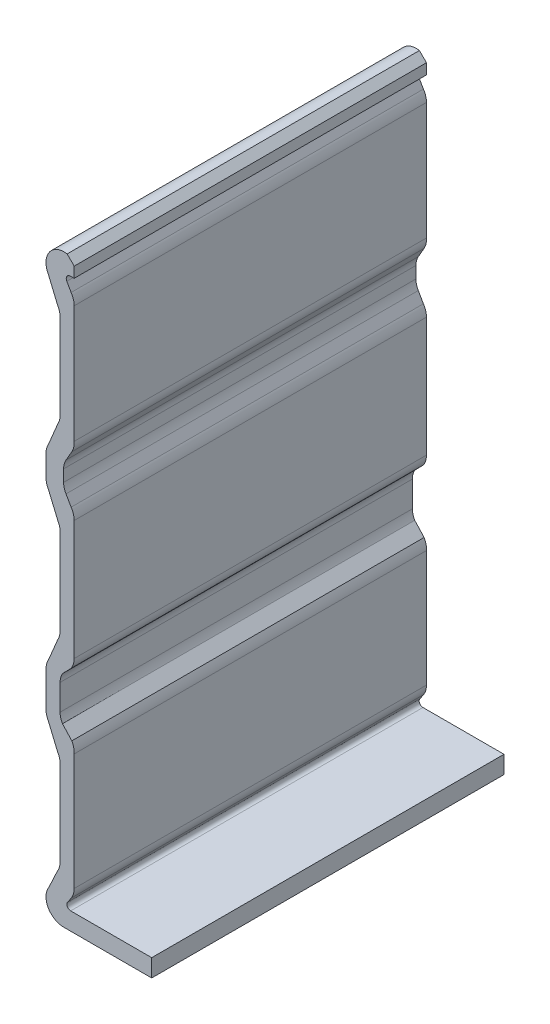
ISO-10303-21;
HEADER;
FILE_DESCRIPTION(('STEP AP214'),'2;1');
FILE_NAME('part.step','',(''),(''),'','','');
FILE_SCHEMA(('AUTOMOTIVE_DESIGN { 1 0 10303 214 1 1 1 1 }'));
ENDSEC;
DATA;
#1=APPLICATION_CONTEXT('core data for automotive mechanical design processes');
#2=APPLICATION_PROTOCOL_DEFINITION('international standard','automotive_design',2000,#1);
#3=PRODUCT_CONTEXT('',#1,'mechanical');
#4=PRODUCT('Part','Part','',(#3));
#5=PRODUCT_RELATED_PRODUCT_CATEGORY('part','',(#4));
#6=PRODUCT_DEFINITION_FORMATION('','',#4);
#7=PRODUCT_DEFINITION_CONTEXT('part definition',#1,'design');
#8=PRODUCT_DEFINITION('design','',#6,#7);
#9=PRODUCT_DEFINITION_SHAPE('','',#8);
#10=(LENGTH_UNIT() NAMED_UNIT(*) SI_UNIT(.MILLI.,.METRE.));
#11=(NAMED_UNIT(*) PLANE_ANGLE_UNIT() SI_UNIT($,.RADIAN.));
#12=(NAMED_UNIT(*) SI_UNIT($,.STERADIAN.) SOLID_ANGLE_UNIT());
#13=UNCERTAINTY_MEASURE_WITH_UNIT(LENGTH_MEASURE(1.E-05),#10,'distance_accuracy_value','');
#14=(GEOMETRIC_REPRESENTATION_CONTEXT(3) GLOBAL_UNCERTAINTY_ASSIGNED_CONTEXT((#13)) GLOBAL_UNIT_ASSIGNED_CONTEXT((#10,
#11,#12)) REPRESENTATION_CONTEXT('',''));
#15=CARTESIAN_POINT('',(0.,0.,0.));
#16=DIRECTION('',(0.,0.,1.));
#17=DIRECTION('',(1.,0.,0.));
#18=AXIS2_PLACEMENT_3D('',#15,#16,#17);
#19=CARTESIAN_POINT('',(-27.2518113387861,44.3804835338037,50.));
#20=DIRECTION('',(0.,0.,-1.));
#21=DIRECTION('',(-1.,0.,0.));
#22=AXIS2_PLACEMENT_3D('',#19,#20,#21);
#23=CYLINDRICAL_SURFACE('',#22,5.26017952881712);
#24=CARTESIAN_POINT('',(-27.2518113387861,44.3804835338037,-50.));
#25=DIRECTION('',(0.,0.,1.));
#26=DIRECTION('',(1.,0.,0.));
#27=AXIS2_PLACEMENT_3D('',#24,#25,#26);
#28=CIRCLE('',#27,5.26017952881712);
#29=CARTESIAN_POINT('',(-22.0001555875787,44.0811500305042,-50.));
#30=VERTEX_POINT('',#29);
#31=CARTESIAN_POINT('',(-22.670033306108,46.9644337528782,-50.));
#32=VERTEX_POINT('',#31);
#33=EDGE_CURVE('E398',#30,#32,#28,.T.);
#34=ORIENTED_EDGE('',*,*,#33,.T.);
#35=DIRECTION('',(0.,0.,-1.));
#36=VECTOR('',#35,1.);
#37=CARTESIAN_POINT('',(-22.670033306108,46.9644337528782,50.));
#38=LINE('',#37,#36);
#39=CARTESIAN_POINT('',(-22.670033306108,46.9644337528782,50.));
#40=VERTEX_POINT('',#39);
#41=EDGE_CURVE('E11',#40,#32,#38,.T.);
#42=ORIENTED_EDGE('',*,*,#41,.F.);
#43=CARTESIAN_POINT('',(-27.2518113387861,44.3804835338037,50.));
#44=DIRECTION('',(0.,0.,1.));
#45=DIRECTION('',(1.,0.,0.));
#46=AXIS2_PLACEMENT_3D('',#43,#44,#45);
#47=CIRCLE('',#46,5.26017952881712);
#48=CARTESIAN_POINT('',(-22.0001555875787,44.0811500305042,50.));
#49=VERTEX_POINT('',#48);
#50=EDGE_CURVE('E502',#49,#40,#47,.T.);
#51=ORIENTED_EDGE('',*,*,#50,.F.);
#52=DIRECTION('',(0.,0.,-1.));
#53=VECTOR('',#52,1.);
#54=CARTESIAN_POINT('',(-22.0001555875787,44.0811500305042,50.));
#55=LINE('',#54,#53);
#56=EDGE_CURVE('E394',#49,#30,#55,.T.);
#57=ORIENTED_EDGE('',*,*,#56,.T.);
#58=EDGE_LOOP('',(#34,#42,#51,#57));
#59=FACE_BOUND('',#58,.T.);
#60=ADVANCED_FACE('F32',(#59),#23,.T.);
#61=CARTESIAN_POINT('',(-22.670033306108,46.9644337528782,50.));
#62=DIRECTION('',(-0.73406342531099,-0.679080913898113,0.));
#63=DIRECTION('',(0.679080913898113,-0.73406342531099,0.));
#64=AXIS2_PLACEMENT_3D('',#61,#62,#63);
#65=PLANE('',#64);
#66=DIRECTION('',(-0.679080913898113,0.73406342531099,0.));
#67=VECTOR('',#66,1.);
#68=CARTESIAN_POINT('',(-22.670033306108,46.9644337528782,-50.));
#69=LINE('',#68,#67);
#70=CARTESIAN_POINT('',(-25.3303061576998,49.8400984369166,-50.));
#71=VERTEX_POINT('',#70);
#72=EDGE_CURVE('E401',#32,#71,#69,.T.);
#73=ORIENTED_EDGE('',*,*,#72,.T.);
#74=DIRECTION('',(0.,0.,-1.));
#75=VECTOR('',#74,1.);
#76=CARTESIAN_POINT('',(-25.3303061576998,49.8400984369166,50.));
#77=LINE('',#76,#75);
#78=CARTESIAN_POINT('',(-25.3303061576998,49.8400984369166,50.));
#79=VERTEX_POINT('',#78);
#80=EDGE_CURVE('E40',#79,#71,#77,.T.);
#81=ORIENTED_EDGE('',*,*,#80,.F.);
#82=DIRECTION('',(-0.679080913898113,0.73406342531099,0.));
#83=VECTOR('',#82,1.);
#84=CARTESIAN_POINT('',(-22.670033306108,46.9644337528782,50.));
#85=LINE('',#84,#83);
#86=EDGE_CURVE('E226',#40,#79,#85,.T.);
#87=ORIENTED_EDGE('',*,*,#86,.F.);
#88=ORIENTED_EDGE('',*,*,#41,.T.);
#89=EDGE_LOOP('',(#73,#81,#87,#88));
#90=FACE_BOUND('',#89,.T.);
#91=ADVANCED_FACE('F785',(#90),#65,.F.);
#92=CARTESIAN_POINT('',(-21.0001485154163,52.3401161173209,50.));
#93=DIRECTION('',(0.,0.,-1.));
#94=DIRECTION('',(-1.,0.,0.));
#95=AXIS2_PLACEMENT_3D('',#92,#93,#94);
#96=CYLINDRICAL_SURFACE('',#95,5.00003536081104);
#97=CARTESIAN_POINT('',(-21.0001485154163,52.3401161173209,-50.));
#98=DIRECTION('',(0.,0.,-1.));
#99=DIRECTION('',(-1.,0.,0.));
#100=AXIS2_PLACEMENT_3D('',#97,#98,#99);
#101=CIRCLE('',#100,5.00003536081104);
#102=CARTESIAN_POINT('',(-26.0001838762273,52.3401161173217,-50.));
#103=VERTEX_POINT('',#102);
#104=EDGE_CURVE('E403',#71,#103,#101,.T.);
#105=ORIENTED_EDGE('',*,*,#104,.T.);
#106=DIRECTION('',(0.,0.,-1.));
#107=VECTOR('',#106,1.);
#108=CARTESIAN_POINT('',(-26.0001838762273,52.3401161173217,50.));
#109=LINE('',#108,#107);
#110=CARTESIAN_POINT('',(-26.0001838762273,52.3401161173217,50.));
#111=VERTEX_POINT('',#110);
#112=EDGE_CURVE('E644',#111,#103,#109,.T.);
#113=ORIENTED_EDGE('',*,*,#112,.F.);
#114=CARTESIAN_POINT('',(-21.0001485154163,52.3401161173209,50.));
#115=DIRECTION('',(0.,0.,-1.));
#116=DIRECTION('',(-1.,0.,0.));
#117=AXIS2_PLACEMENT_3D('',#114,#115,#116);
#118=CIRCLE('',#117,5.00003536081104);
#119=EDGE_CURVE('E652',#79,#111,#118,.T.);
#120=ORIENTED_EDGE('',*,*,#119,.F.);
#121=ORIENTED_EDGE('',*,*,#80,.T.);
#122=EDGE_LOOP('',(#105,#113,#120,#121));
#123=FACE_BOUND('',#122,.T.);
#124=ADVANCED_FACE('F650',(#123),#96,.F.);
#125=CARTESIAN_POINT('',(-26.0001838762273,52.3401161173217,50.));
#126=DIRECTION('',(-1.,0.,0.));
#127=DIRECTION('',(0.,0.,1.));
#128=AXIS2_PLACEMENT_3D('',#125,#126,#127);
#129=PLANE('',#128);
#130=DIRECTION('',(0.,1.,0.));
#131=VECTOR('',#130,1.);
#132=CARTESIAN_POINT('',(-26.0001838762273,52.3401161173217,-50.));
#133=LINE('',#132,#131);
#134=CARTESIAN_POINT('',(-26.0001838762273,59.6606759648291,-50.));
#135=VERTEX_POINT('',#134);
#136=EDGE_CURVE('E405',#103,#135,#133,.T.);
#137=ORIENTED_EDGE('',*,*,#136,.T.);
#138=DIRECTION('',(0.,0.,-1.));
#139=VECTOR('',#138,1.);
#140=CARTESIAN_POINT('',(-26.0001838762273,59.6606759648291,50.));
#141=LINE('',#140,#139);
#142=CARTESIAN_POINT('',(-26.0001838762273,59.6606759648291,50.));
#143=VERTEX_POINT('',#142);
#144=EDGE_CURVE('E641',#143,#135,#141,.T.);
#145=ORIENTED_EDGE('',*,*,#144,.F.);
#146=DIRECTION('',(0.,1.,0.));
#147=VECTOR('',#146,1.);
#148=CARTESIAN_POINT('',(-26.0001838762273,52.3401161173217,50.));
#149=LINE('',#148,#147);
#150=EDGE_CURVE('E670',#111,#143,#149,.T.);
#151=ORIENTED_EDGE('',*,*,#150,.F.);
#152=ORIENTED_EDGE('',*,*,#112,.T.);
#153=EDGE_LOOP('',(#137,#145,#151,#152));
#154=FACE_BOUND('',#153,.T.);
#155=ADVANCED_FACE('F661',(#154),#129,.F.);
#156=CARTESIAN_POINT('',(-21.0001485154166,59.6606759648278,50.));
#157=DIRECTION('',(0.,0.,-1.));
#158=DIRECTION('',(-1.,0.,0.));
#159=AXIS2_PLACEMENT_3D('',#156,#157,#158);
#160=CYLINDRICAL_SURFACE('',#159,5.00003536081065);
#161=CARTESIAN_POINT('',(-21.0001485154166,59.6606759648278,-50.));
#162=DIRECTION('',(0.,0.,-1.));
#163=DIRECTION('',(-1.,0.,0.));
#164=AXIS2_PLACEMENT_3D('',#161,#162,#163);
#165=CIRCLE('',#164,5.00003536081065);
#166=CARTESIAN_POINT('',(-25.330306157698,62.1606936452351,-50.));
#167=VERTEX_POINT('',#166);
#168=EDGE_CURVE('E407',#135,#167,#165,.T.);
#169=ORIENTED_EDGE('',*,*,#168,.T.);
#170=DIRECTION('',(0.,0.,-1.));
#171=VECTOR('',#170,1.);
#172=CARTESIAN_POINT('',(-25.330306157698,62.1606936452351,50.));
#173=LINE('',#172,#171);
#174=CARTESIAN_POINT('',(-25.330306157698,62.1606936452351,50.));
#175=VERTEX_POINT('',#174);
#176=EDGE_CURVE('E638',#175,#167,#173,.T.);
#177=ORIENTED_EDGE('',*,*,#176,.F.);
#178=CARTESIAN_POINT('',(-21.0001485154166,59.6606759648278,50.));
#179=DIRECTION('',(0.,0.,-1.));
#180=DIRECTION('',(-1.,0.,0.));
#181=AXIS2_PLACEMENT_3D('',#178,#179,#180);
#182=CIRCLE('',#181,5.00003536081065);
#183=EDGE_CURVE('E667',#143,#175,#182,.T.);
#184=ORIENTED_EDGE('',*,*,#183,.F.);
#185=ORIENTED_EDGE('',*,*,#144,.T.);
#186=EDGE_LOOP('',(#169,#177,#184,#185));
#187=FACE_BOUND('',#186,.T.);
#188=ADVANCED_FACE('F665',(#187),#160,.F.);
#189=CARTESIAN_POINT('',(-25.330306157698,62.1606936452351,50.));
#190=DIRECTION('',(-0.717291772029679,0.69677292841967,0.));
#191=DIRECTION('',(-0.69677292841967,-0.717291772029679,0.));
#192=AXIS2_PLACEMENT_3D('',#189,#190,#191);
#193=PLANE('',#192);
#194=DIRECTION('',(0.69677292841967,0.717291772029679,0.));
#195=VECTOR('',#194,1.);
#196=CARTESIAN_POINT('',(-25.330306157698,62.1606936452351,-50.));
#197=LINE('',#196,#195);
#198=CARTESIAN_POINT('',(-22.8650953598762,64.6985009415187,-50.));
#199=VERTEX_POINT('',#198);
#200=EDGE_CURVE('E409',#167,#199,#197,.T.);
#201=ORIENTED_EDGE('',*,*,#200,.T.);
#202=DIRECTION('',(0.,0.,-1.));
#203=VECTOR('',#202,1.);
#204=CARTESIAN_POINT('',(-22.8650953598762,64.6985009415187,50.));
#205=LINE('',#204,#203);
#206=CARTESIAN_POINT('',(-22.8650953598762,64.6985009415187,50.));
#207=VERTEX_POINT('',#206);
#208=EDGE_CURVE('E635',#207,#199,#205,.T.);
#209=ORIENTED_EDGE('',*,*,#208,.F.);
#210=DIRECTION('',(0.69677292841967,0.717291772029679,0.));
#211=VECTOR('',#210,1.);
#212=CARTESIAN_POINT('',(-25.330306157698,62.1606936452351,50.));
#213=LINE('',#212,#211);
#214=EDGE_CURVE('E669',#175,#207,#213,.T.);
#215=ORIENTED_EDGE('',*,*,#214,.F.);
#216=ORIENTED_EDGE('',*,*,#176,.T.);
#217=EDGE_LOOP('',(#201,#209,#215,#216));
#218=FACE_BOUND('',#217,.T.);
#219=ADVANCED_FACE('F798',(#218),#193,.F.);
#220=CARTESIAN_POINT('',(-27.1872763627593,67.5665814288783,50.));
#221=DIRECTION('',(0.,0.,-1.));
#222=DIRECTION('',(-1.,0.,0.));
#223=AXIS2_PLACEMENT_3D('',#220,#221,#222);
#224=CYLINDRICAL_SURFACE('',#223,5.1872087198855);
#225=CARTESIAN_POINT('',(-27.1872763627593,67.5665814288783,-50.));
#226=DIRECTION('',(0.,0.,1.));
#227=DIRECTION('',(1.,0.,0.));
#228=AXIS2_PLACEMENT_3D('',#225,#226,#227);
#229=CIRCLE('',#228,5.1872087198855);
#230=CARTESIAN_POINT('',(-22.0001555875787,67.5363760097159,-50.));
#231=VERTEX_POINT('',#230);
#232=EDGE_CURVE('E411',#199,#231,#229,.T.);
#233=ORIENTED_EDGE('',*,*,#232,.T.);
#234=DIRECTION('',(0.,0.,-1.));
#235=VECTOR('',#234,1.);
#236=CARTESIAN_POINT('',(-22.0001555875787,67.5363760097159,50.));
#237=LINE('',#236,#235);
#238=CARTESIAN_POINT('',(-22.0001555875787,67.5363760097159,50.));
#239=VERTEX_POINT('',#238);
#240=EDGE_CURVE('E632',#239,#231,#237,.T.);
#241=ORIENTED_EDGE('',*,*,#240,.F.);
#242=CARTESIAN_POINT('',(-27.1872763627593,67.5665814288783,50.));
#243=DIRECTION('',(0.,0.,1.));
#244=DIRECTION('',(1.,0.,0.));
#245=AXIS2_PLACEMENT_3D('',#242,#243,#244);
#246=CIRCLE('',#245,5.1872087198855);
#247=EDGE_CURVE('E672',#207,#239,#246,.T.);
#248=ORIENTED_EDGE('',*,*,#247,.F.);
#249=ORIENTED_EDGE('',*,*,#208,.T.);
#250=EDGE_LOOP('',(#233,#241,#248,#249));
#251=FACE_BOUND('',#250,.T.);
#252=ADVANCED_FACE('F801',(#251),#224,.T.);
#253=CARTESIAN_POINT('',(-22.0001555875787,67.5363760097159,50.));
#254=DIRECTION('',(-1.,0.,0.));
#255=DIRECTION('',(0.,0.,1.));
#256=AXIS2_PLACEMENT_3D('',#253,#254,#255);
#257=PLANE('',#256);
#258=DIRECTION('',(0.,1.,0.));
#259=VECTOR('',#258,1.);
#260=CARTESIAN_POINT('',(-22.0001555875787,67.5363760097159,-50.));
#261=LINE('',#260,#259);
#262=CARTESIAN_POINT('',(-22.0001555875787,101.464819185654,-50.));
#263=VERTEX_POINT('',#262);
#264=EDGE_CURVE('E413',#231,#263,#261,.T.);
#265=ORIENTED_EDGE('',*,*,#264,.T.);
#266=DIRECTION('',(0.,0.,-1.));
#267=VECTOR('',#266,1.);
#268=CARTESIAN_POINT('',(-22.0001555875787,101.464819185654,50.));
#269=LINE('',#268,#267);
#270=CARTESIAN_POINT('',(-22.0001555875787,101.464819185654,50.));
#271=VERTEX_POINT('',#270);
#272=EDGE_CURVE('E629',#271,#263,#269,.T.);
#273=ORIENTED_EDGE('',*,*,#272,.F.);
#274=DIRECTION('',(0.,1.,0.));
#275=VECTOR('',#274,1.);
#276=CARTESIAN_POINT('',(-22.0001555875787,67.5363760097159,50.));
#277=LINE('',#276,#275);
#278=EDGE_CURVE('E678',#239,#271,#277,.T.);
#279=ORIENTED_EDGE('',*,*,#278,.F.);
#280=ORIENTED_EDGE('',*,*,#240,.T.);
#281=EDGE_LOOP('',(#265,#273,#279,#280));
#282=FACE_BOUND('',#281,.T.);
#283=ADVANCED_FACE('F805',(#282),#257,.F.);
#284=CARTESIAN_POINT('',(-27.1872763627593,101.434613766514,50.));
#285=DIRECTION('',(0.,0.,-1.));
#286=DIRECTION('',(-1.,0.,0.));
#287=AXIS2_PLACEMENT_3D('',#284,#285,#286);
#288=CYLINDRICAL_SURFACE('',#287,5.18720871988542);
#289=CARTESIAN_POINT('',(-27.1872763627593,101.434613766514,-50.));
#290=DIRECTION('',(0.,0.,1.));
#291=DIRECTION('',(1.,0.,0.));
#292=AXIS2_PLACEMENT_3D('',#289,#290,#291);
#293=CIRCLE('',#292,5.18720871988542);
#294=CARTESIAN_POINT('',(-22.865095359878,104.302694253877,-50.));
#295=VERTEX_POINT('',#294);
#296=EDGE_CURVE('E415',#263,#295,#293,.T.);
#297=ORIENTED_EDGE('',*,*,#296,.T.);
#298=DIRECTION('',(0.,0.,-1.));
#299=VECTOR('',#298,1.);
#300=CARTESIAN_POINT('',(-22.865095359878,104.302694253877,50.));
#301=LINE('',#300,#299);
#302=CARTESIAN_POINT('',(-22.865095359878,104.302694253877,50.));
#303=VERTEX_POINT('',#302);
#304=EDGE_CURVE('E626',#303,#295,#301,.T.);
#305=ORIENTED_EDGE('',*,*,#304,.F.);
#306=CARTESIAN_POINT('',(-27.1872763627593,101.434613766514,50.));
#307=DIRECTION('',(0.,0.,1.));
#308=DIRECTION('',(1.,0.,0.));
#309=AXIS2_PLACEMENT_3D('',#306,#307,#308);
#310=CIRCLE('',#309,5.18720871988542);
#311=EDGE_CURVE('E680',#271,#303,#310,.T.);
#312=ORIENTED_EDGE('',*,*,#311,.F.);
#313=ORIENTED_EDGE('',*,*,#272,.T.);
#314=EDGE_LOOP('',(#297,#305,#312,#313));
#315=FACE_BOUND('',#314,.T.);
#316=ADVANCED_FACE('F809',(#315),#288,.T.);
#317=CARTESIAN_POINT('',(-22.865095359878,104.302694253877,50.));
#318=DIRECTION('',(-0.866025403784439,-0.499999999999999,0.));
#319=DIRECTION('',(0.499999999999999,-0.866025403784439,0.));
#320=AXIS2_PLACEMENT_3D('',#317,#318,#319);
#321=PLANE('',#320);
#322=DIRECTION('',(-0.499999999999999,0.866025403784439,0.));
#323=VECTOR('',#322,1.);
#324=CARTESIAN_POINT('',(-22.865095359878,104.302694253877,-50.));
#325=LINE('',#324,#323);
#326=CARTESIAN_POINT('',(-24.3302990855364,106.840501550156,-50.));
#327=VERTEX_POINT('',#326);
#328=EDGE_CURVE('E417',#295,#327,#325,.T.);
#329=ORIENTED_EDGE('',*,*,#328,.T.);
#330=DIRECTION('',(0.,0.,-1.));
#331=VECTOR('',#330,1.);
#332=CARTESIAN_POINT('',(-24.3302990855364,106.840501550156,50.));
#333=LINE('',#332,#331);
#334=CARTESIAN_POINT('',(-24.3302990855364,106.840501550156,50.));
#335=VERTEX_POINT('',#334);
#336=EDGE_CURVE('E623',#335,#327,#333,.T.);
#337=ORIENTED_EDGE('',*,*,#336,.F.);
#338=DIRECTION('',(-0.499999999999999,0.866025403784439,0.));
#339=VECTOR('',#338,1.);
#340=CARTESIAN_POINT('',(-22.865095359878,104.302694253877,50.));
#341=LINE('',#340,#339);
#342=EDGE_CURVE('E682',#303,#335,#341,.T.);
#343=ORIENTED_EDGE('',*,*,#342,.F.);
#344=ORIENTED_EDGE('',*,*,#304,.T.);
#345=EDGE_LOOP('',(#329,#337,#343,#344));
#346=FACE_BOUND('',#345,.T.);
#347=ADVANCED_FACE('F813',(#346),#321,.F.);
#348=CARTESIAN_POINT('',(-20.0001414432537,109.340519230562,50.));
#349=DIRECTION('',(0.,0.,-1.));
#350=DIRECTION('',(-1.,0.,0.));
#351=AXIS2_PLACEMENT_3D('',#348,#349,#350);
#352=CYLINDRICAL_SURFACE('',#351,5.00003536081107);
#353=CARTESIAN_POINT('',(-20.0001414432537,109.340519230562,-50.));
#354=DIRECTION('',(0.,0.,-1.));
#355=DIRECTION('',(-1.,0.,0.));
#356=AXIS2_PLACEMENT_3D('',#353,#354,#355);
#357=CIRCLE('',#356,5.00003536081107);
#358=CARTESIAN_POINT('',(-25.0001768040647,109.340519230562,-50.));
#359=VERTEX_POINT('',#358);
#360=EDGE_CURVE('E419',#327,#359,#357,.T.);
#361=ORIENTED_EDGE('',*,*,#360,.T.);
#362=DIRECTION('',(0.,0.,-1.));
#363=VECTOR('',#362,1.);
#364=CARTESIAN_POINT('',(-25.0001768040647,109.340519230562,50.));
#365=LINE('',#364,#363);
#366=CARTESIAN_POINT('',(-25.0001768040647,109.340519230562,50.));
#367=VERTEX_POINT('',#366);
#368=EDGE_CURVE('E620',#367,#359,#365,.T.);
#369=ORIENTED_EDGE('',*,*,#368,.F.);
#370=CARTESIAN_POINT('',(-20.0001414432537,109.340519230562,50.));
#371=DIRECTION('',(0.,0.,-1.));
#372=DIRECTION('',(-1.,0.,0.));
#373=AXIS2_PLACEMENT_3D('',#370,#371,#372);
#374=CIRCLE('',#373,5.00003536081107);
#375=EDGE_CURVE('E684',#335,#367,#374,.T.);
#376=ORIENTED_EDGE('',*,*,#375,.F.);
#377=ORIENTED_EDGE('',*,*,#336,.T.);
#378=EDGE_LOOP('',(#361,#369,#376,#377));
#379=FACE_BOUND('',#378,.T.);
#380=ADVANCED_FACE('F817',(#379),#352,.F.);
#381=CARTESIAN_POINT('',(-25.0001768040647,109.340519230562,50.));
#382=DIRECTION('',(-1.,0.,0.));
#383=DIRECTION('',(0.,0.,1.));
#384=AXIS2_PLACEMENT_3D('',#381,#382,#383);
#385=PLANE('',#384);
#386=DIRECTION('',(0.,1.,0.));
#387=VECTOR('',#386,1.);
#388=CARTESIAN_POINT('',(-25.0001768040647,109.340519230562,-50.));
#389=LINE('',#388,#387);
#390=CARTESIAN_POINT('',(-25.0001768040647,112.661050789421,-50.));
#391=VERTEX_POINT('',#390);
#392=EDGE_CURVE('E421',#359,#391,#389,.T.);
#393=ORIENTED_EDGE('',*,*,#392,.T.);
#394=DIRECTION('',(0.,0.,-1.));
#395=VECTOR('',#394,1.);
#396=CARTESIAN_POINT('',(-25.0001768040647,112.661050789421,50.));
#397=LINE('',#396,#395);
#398=CARTESIAN_POINT('',(-25.0001768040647,112.661050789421,50.));
#399=VERTEX_POINT('',#398);
#400=EDGE_CURVE('E617',#399,#391,#397,.T.);
#401=ORIENTED_EDGE('',*,*,#400,.F.);
#402=DIRECTION('',(0.,1.,0.));
#403=VECTOR('',#402,1.);
#404=CARTESIAN_POINT('',(-25.0001768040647,109.340519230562,50.));
#405=LINE('',#404,#403);
#406=EDGE_CURVE('E686',#367,#399,#405,.T.);
#407=ORIENTED_EDGE('',*,*,#406,.F.);
#408=ORIENTED_EDGE('',*,*,#368,.T.);
#409=EDGE_LOOP('',(#393,#401,#407,#408));
#410=FACE_BOUND('',#409,.T.);
#411=ADVANCED_FACE('F821',(#410),#385,.F.);
#412=CARTESIAN_POINT('',(-20.0001414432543,112.661050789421,50.));
#413=DIRECTION('',(0.,0.,-1.));
#414=DIRECTION('',(-1.,0.,0.));
#415=AXIS2_PLACEMENT_3D('',#412,#413,#414);
#416=CYLINDRICAL_SURFACE('',#415,5.00003536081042);
#417=CARTESIAN_POINT('',(-20.0001414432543,112.661050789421,-50.));
#418=DIRECTION('',(0.,0.,-1.));
#419=DIRECTION('',(-1.,0.,0.));
#420=AXIS2_PLACEMENT_3D('',#417,#418,#419);
#421=CIRCLE('',#420,5.00003536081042);
#422=CARTESIAN_POINT('',(-24.3302990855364,115.161068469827,-50.));
#423=VERTEX_POINT('',#422);
#424=EDGE_CURVE('E423',#391,#423,#421,.T.);
#425=ORIENTED_EDGE('',*,*,#424,.T.);
#426=DIRECTION('',(0.,0.,-1.));
#427=VECTOR('',#426,1.);
#428=CARTESIAN_POINT('',(-24.3302990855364,115.161068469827,50.));
#429=LINE('',#428,#427);
#430=CARTESIAN_POINT('',(-24.3302990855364,115.161068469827,50.));
#431=VERTEX_POINT('',#430);
#432=EDGE_CURVE('E614',#431,#423,#429,.T.);
#433=ORIENTED_EDGE('',*,*,#432,.F.);
#434=CARTESIAN_POINT('',(-20.0001414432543,112.661050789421,50.));
#435=DIRECTION('',(0.,0.,-1.));
#436=DIRECTION('',(-1.,0.,0.));
#437=AXIS2_PLACEMENT_3D('',#434,#435,#436);
#438=CIRCLE('',#437,5.00003536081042);
#439=EDGE_CURVE('E688',#399,#431,#438,.T.);
#440=ORIENTED_EDGE('',*,*,#439,.F.);
#441=ORIENTED_EDGE('',*,*,#400,.T.);
#442=EDGE_LOOP('',(#425,#433,#440,#441));
#443=FACE_BOUND('',#442,.T.);
#444=ADVANCED_FACE('F825',(#443),#416,.F.);
#445=CARTESIAN_POINT('',(-24.3302990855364,115.161068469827,50.));
#446=DIRECTION('',(-0.866025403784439,0.499999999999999,0.));
#447=DIRECTION('',(-0.499999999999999,-0.866025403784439,0.));
#448=AXIS2_PLACEMENT_3D('',#445,#446,#447);
#449=PLANE('',#448);
#450=DIRECTION('',(0.499999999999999,0.866025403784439,0.));
#451=VECTOR('',#450,1.);
#452=CARTESIAN_POINT('',(-24.3302990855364,115.161068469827,-50.));
#453=LINE('',#452,#451);
#454=CARTESIAN_POINT('',(-22.6700333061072,118.036733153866,-50.));
#455=VERTEX_POINT('',#454);
#456=EDGE_CURVE('E425',#423,#455,#453,.T.);
#457=ORIENTED_EDGE('',*,*,#456,.T.);
#458=DIRECTION('',(0.,0.,-1.));
#459=VECTOR('',#458,1.);
#460=CARTESIAN_POINT('',(-22.6700333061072,118.036733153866,50.));
#461=LINE('',#460,#459);
#462=CARTESIAN_POINT('',(-22.6700333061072,118.036733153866,50.));
#463=VERTEX_POINT('',#462);
#464=EDGE_CURVE('E611',#463,#455,#461,.T.);
#465=ORIENTED_EDGE('',*,*,#464,.F.);
#466=DIRECTION('',(0.499999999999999,0.866025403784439,0.));
#467=VECTOR('',#466,1.);
#468=CARTESIAN_POINT('',(-24.3302990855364,115.161068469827,50.));
#469=LINE('',#468,#467);
#470=EDGE_CURVE('E690',#431,#463,#469,.T.);
#471=ORIENTED_EDGE('',*,*,#470,.F.);
#472=ORIENTED_EDGE('',*,*,#432,.T.);
#473=EDGE_LOOP('',(#457,#465,#471,#472));
#474=FACE_BOUND('',#473,.T.);
#475=ADVANCED_FACE('F829',(#474),#449,.F.);
#476=CARTESIAN_POINT('',(-27.2518113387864,120.620683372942,50.));
#477=DIRECTION('',(0.,0.,-1.));
#478=DIRECTION('',(-1.,0.,0.));
#479=AXIS2_PLACEMENT_3D('',#476,#477,#478);
#480=CYLINDRICAL_SURFACE('',#479,5.26017952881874);
#481=CARTESIAN_POINT('',(-27.2518113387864,120.620683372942,-50.));
#482=DIRECTION('',(0.,0.,1.));
#483=DIRECTION('',(1.,0.,0.));
#484=AXIS2_PLACEMENT_3D('',#481,#482,#483);
#485=CIRCLE('',#484,5.26017952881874);
#486=CARTESIAN_POINT('',(-22.0001555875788,120.920016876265,-50.));
#487=VERTEX_POINT('',#486);
#488=EDGE_CURVE('E427',#455,#487,#485,.T.);
#489=ORIENTED_EDGE('',*,*,#488,.T.);
#490=DIRECTION('',(0.,0.,-1.));
#491=VECTOR('',#490,1.);
#492=CARTESIAN_POINT('',(-22.0001555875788,120.920016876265,50.));
#493=LINE('',#492,#491);
#494=CARTESIAN_POINT('',(-22.0001555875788,120.920016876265,50.));
#495=VERTEX_POINT('',#494);
#496=EDGE_CURVE('E608',#495,#487,#493,.T.);
#497=ORIENTED_EDGE('',*,*,#496,.F.);
#498=CARTESIAN_POINT('',(-27.2518113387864,120.620683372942,50.));
#499=DIRECTION('',(0.,0.,1.));
#500=DIRECTION('',(1.,0.,0.));
#501=AXIS2_PLACEMENT_3D('',#498,#499,#500);
#502=CIRCLE('',#501,5.26017952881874);
#503=EDGE_CURVE('E692',#463,#495,#502,.T.);
#504=ORIENTED_EDGE('',*,*,#503,.F.);
#505=ORIENTED_EDGE('',*,*,#464,.T.);
#506=EDGE_LOOP('',(#489,#497,#504,#505));
#507=FACE_BOUND('',#506,.T.);
#508=ADVANCED_FACE('F833',(#507),#480,.T.);
#509=CARTESIAN_POINT('',(-22.0001555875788,120.920016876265,50.));
#510=DIRECTION('',(-1.,0.,0.));
#511=DIRECTION('',(0.,0.,1.));
#512=AXIS2_PLACEMENT_3D('',#509,#510,#511);
#513=PLANE('',#512);
#514=DIRECTION('',(0.,1.,0.));
#515=VECTOR('',#514,1.);
#516=CARTESIAN_POINT('',(-22.0001555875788,120.920016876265,-50.));
#517=LINE('',#516,#515);
#518=CARTESIAN_POINT('',(-22.0001555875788,154.244681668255,-50.));
#519=VERTEX_POINT('',#518);
#520=EDGE_CURVE('E429',#487,#519,#517,.T.);
#521=ORIENTED_EDGE('',*,*,#520,.T.);
#522=DIRECTION('',(0.,0.,-1.));
#523=VECTOR('',#522,1.);
#524=CARTESIAN_POINT('',(-22.0001555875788,154.244681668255,50.));
#525=LINE('',#524,#523);
#526=CARTESIAN_POINT('',(-22.0001555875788,154.244681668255,50.));
#527=VERTEX_POINT('',#526);
#528=EDGE_CURVE('E605',#527,#519,#525,.T.);
#529=ORIENTED_EDGE('',*,*,#528,.F.);
#530=DIRECTION('',(0.,1.,0.));
#531=VECTOR('',#530,1.);
#532=CARTESIAN_POINT('',(-22.0001555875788,120.920016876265,50.));
#533=LINE('',#532,#531);
#534=EDGE_CURVE('E694',#495,#527,#533,.T.);
#535=ORIENTED_EDGE('',*,*,#534,.F.);
#536=ORIENTED_EDGE('',*,*,#496,.T.);
#537=EDGE_LOOP('',(#521,#529,#535,#536));
#538=FACE_BOUND('',#537,.T.);
#539=ADVANCED_FACE('F837',(#538),#513,.F.);
#540=CARTESIAN_POINT('',(-27.1872763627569,154.214476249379,50.));
#541=DIRECTION('',(0.,0.,-1.));
#542=DIRECTION('',(-1.,0.,0.));
#543=AXIS2_PLACEMENT_3D('',#540,#541,#542);
#544=CYLINDRICAL_SURFACE('',#543,5.18720871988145);
#545=CARTESIAN_POINT('',(-27.1872763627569,154.214476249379,-50.));
#546=DIRECTION('',(0.,0.,1.));
#547=DIRECTION('',(1.,0.,0.));
#548=AXIS2_PLACEMENT_3D('',#545,#546,#547);
#549=CIRCLE('',#548,5.18720871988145);
#550=CARTESIAN_POINT('',(-22.865095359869,157.082556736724,-50.));
#551=VERTEX_POINT('',#550);
#552=EDGE_CURVE('E431',#519,#551,#549,.T.);
#553=ORIENTED_EDGE('',*,*,#552,.T.);
#554=DIRECTION('',(0.,0.,-1.));
#555=VECTOR('',#554,1.);
#556=CARTESIAN_POINT('',(-22.865095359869,157.082556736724,50.));
#557=LINE('',#556,#555);
#558=CARTESIAN_POINT('',(-22.865095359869,157.082556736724,50.));
#559=VERTEX_POINT('',#558);
#560=EDGE_CURVE('E602',#559,#551,#557,.T.);
#561=ORIENTED_EDGE('',*,*,#560,.F.);
#562=CARTESIAN_POINT('',(-27.1872763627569,154.214476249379,50.));
#563=DIRECTION('',(0.,0.,1.));
#564=DIRECTION('',(1.,0.,0.));
#565=AXIS2_PLACEMENT_3D('',#562,#563,#564);
#566=CIRCLE('',#565,5.18720871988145);
#567=EDGE_CURVE('E696',#527,#559,#566,.T.);
#568=ORIENTED_EDGE('',*,*,#567,.F.);
#569=ORIENTED_EDGE('',*,*,#528,.T.);
#570=EDGE_LOOP('',(#553,#561,#568,#569));
#571=FACE_BOUND('',#570,.T.);
#572=ADVANCED_FACE('F841',(#571),#544,.T.);
#573=CARTESIAN_POINT('',(-22.865095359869,157.082556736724,50.));
#574=DIRECTION('',(-0.866025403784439,-0.5,0.));
#575=DIRECTION('',(0.5,-0.866025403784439,0.));
#576=AXIS2_PLACEMENT_3D('',#573,#574,#575);
#577=PLANE('',#576);
#578=DIRECTION('',(-0.499999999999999,0.866025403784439,0.));
#579=VECTOR('',#578,1.);
#580=CARTESIAN_POINT('',(-22.865095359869,157.082556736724,-50.));
#581=LINE('',#580,#579);
#582=CARTESIAN_POINT('',(-24.1002376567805,159.221885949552,-50.));
#583=VERTEX_POINT('',#582);
#584=EDGE_CURVE('E433',#551,#583,#581,.T.);
#585=ORIENTED_EDGE('',*,*,#584,.T.);
#586=DIRECTION('',(0.,0.,-1.));
#587=VECTOR('',#586,1.);
#588=CARTESIAN_POINT('',(-24.1002376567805,159.221885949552,50.));
#589=LINE('',#588,#587);
#590=CARTESIAN_POINT('',(-24.1002376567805,159.221885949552,50.));
#591=VERTEX_POINT('',#590);
#592=EDGE_CURVE('E599',#591,#583,#589,.T.);
#593=ORIENTED_EDGE('',*,*,#592,.F.);
#594=DIRECTION('',(-0.499999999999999,0.866025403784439,0.));
#595=VECTOR('',#594,1.);
#596=CARTESIAN_POINT('',(-22.865095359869,157.082556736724,50.));
#597=LINE('',#596,#595);
#598=EDGE_CURVE('E698',#559,#591,#597,.T.);
#599=ORIENTED_EDGE('',*,*,#598,.F.);
#600=ORIENTED_EDGE('',*,*,#560,.T.);
#601=EDGE_LOOP('',(#585,#593,#599,#600));
#602=FACE_BOUND('',#601,.T.);
#603=ADVANCED_FACE('F845',(#602),#577,.F.);
#604=CARTESIAN_POINT('',(-23.0729856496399,159.814970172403,50.));
#605=DIRECTION('',(0.,0.,-1.));
#606=DIRECTION('',(-1.,0.,0.));
#607=AXIS2_PLACEMENT_3D('',#604,#605,#606);
#608=CYLINDRICAL_SURFACE('',#607,1.18616844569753);
#609=CARTESIAN_POINT('',(-23.0729856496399,159.814970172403,-50.));
#610=DIRECTION('',(0.,0.,-1.));
#611=DIRECTION('',(-1.,0.,0.));
#612=AXIS2_PLACEMENT_3D('',#609,#610,#611);
#613=CIRCLE('',#612,1.18616844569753);
#614=CARTESIAN_POINT('',(-23.0729856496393,161.0011386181,-50.));
#615=VERTEX_POINT('',#614);
#616=EDGE_CURVE('E435',#583,#615,#613,.T.);
#617=ORIENTED_EDGE('',*,*,#616,.T.);
#618=DIRECTION('',(0.,0.,-1.));
#619=VECTOR('',#618,1.);
#620=CARTESIAN_POINT('',(-23.0729856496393,161.0011386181,50.));
#621=LINE('',#620,#619);
#622=CARTESIAN_POINT('',(-23.0729856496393,161.0011386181,50.));
#623=VERTEX_POINT('',#622);
#624=EDGE_CURVE('E596',#623,#615,#621,.T.);
#625=ORIENTED_EDGE('',*,*,#624,.F.);
#626=CARTESIAN_POINT('',(-23.0729856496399,159.814970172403,50.));
#627=DIRECTION('',(0.,0.,-1.));
#628=DIRECTION('',(-1.,0.,0.));
#629=AXIS2_PLACEMENT_3D('',#626,#627,#628);
#630=CIRCLE('',#629,1.18616844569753);
#631=EDGE_CURVE('E700',#591,#623,#630,.T.);
#632=ORIENTED_EDGE('',*,*,#631,.F.);
#633=ORIENTED_EDGE('',*,*,#592,.T.);
#634=EDGE_LOOP('',(#617,#625,#632,#633));
#635=FACE_BOUND('',#634,.T.);
#636=ADVANCED_FACE('F849',(#635),#608,.F.);
#637=CARTESIAN_POINT('',(-23.0729856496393,161.0011386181,50.));
#638=DIRECTION('',(0.,1.,0.));
#639=DIRECTION('',(0.,0.,1.));
#640=AXIS2_PLACEMENT_3D('',#637,#638,#639);
#641=PLANE('',#640);
#642=DIRECTION('',(1.,0.,0.));
#643=VECTOR('',#642,1.);
#644=CARTESIAN_POINT('',(-23.0729856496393,161.0011386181,-50.));
#645=LINE('',#644,#643);
#646=CARTESIAN_POINT('',(-22.0001555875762,161.0011386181,-50.));
#647=VERTEX_POINT('',#646);
#648=EDGE_CURVE('E437',#615,#647,#645,.T.);
#649=ORIENTED_EDGE('',*,*,#648,.T.);
#650=DIRECTION('',(0.,0.,-1.));
#651=VECTOR('',#650,1.);
#652=CARTESIAN_POINT('',(-22.0001555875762,161.0011386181,50.));
#653=LINE('',#652,#651);
#654=CARTESIAN_POINT('',(-22.0001555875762,161.0011386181,50.));
#655=VERTEX_POINT('',#654);
#656=EDGE_CURVE('E593',#655,#647,#653,.T.);
#657=ORIENTED_EDGE('',*,*,#656,.F.);
#658=DIRECTION('',(1.,0.,0.));
#659=VECTOR('',#658,1.);
#660=CARTESIAN_POINT('',(-23.0729856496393,161.0011386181,50.));
#661=LINE('',#660,#659);
#662=EDGE_CURVE('E702',#623,#655,#661,.T.);
#663=ORIENTED_EDGE('',*,*,#662,.F.);
#664=ORIENTED_EDGE('',*,*,#624,.T.);
#665=EDGE_LOOP('',(#649,#657,#663,#664));
#666=FACE_BOUND('',#665,.T.);
#667=ADVANCED_FACE('F853',(#666),#641,.F.);
#668=CARTESIAN_POINT('',(-22.0001555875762,161.0011386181,50.));
#669=DIRECTION('',(-1.,0.,0.));
#670=DIRECTION('',(0.,0.,1.));
#671=AXIS2_PLACEMENT_3D('',#668,#669,#670);
#672=PLANE('',#671);
#673=DIRECTION('',(0.,1.,0.));
#674=VECTOR('',#673,1.);
#675=CARTESIAN_POINT('',(-22.0001555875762,161.0011386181,-50.));
#676=LINE('',#675,#674);
#677=CARTESIAN_POINT('',(-22.0001555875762,164.001159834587,-50.));
#678=VERTEX_POINT('',#677);
#679=EDGE_CURVE('E439',#647,#678,#676,.T.);
#680=ORIENTED_EDGE('',*,*,#679,.T.);
#681=DIRECTION('',(0.,0.,-1.));
#682=VECTOR('',#681,1.);
#683=CARTESIAN_POINT('',(-22.0001555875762,164.001159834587,50.));
#684=LINE('',#683,#682);
#685=CARTESIAN_POINT('',(-22.0001555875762,164.001159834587,50.));
#686=VERTEX_POINT('',#685);
#687=EDGE_CURVE('E590',#686,#678,#684,.T.);
#688=ORIENTED_EDGE('',*,*,#687,.F.);
#689=DIRECTION('',(0.,1.,0.));
#690=VECTOR('',#689,1.);
#691=CARTESIAN_POINT('',(-22.0001555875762,161.0011386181,50.));
#692=LINE('',#691,#690);
#693=EDGE_CURVE('E704',#655,#686,#692,.T.);
#694=ORIENTED_EDGE('',*,*,#693,.F.);
#695=ORIENTED_EDGE('',*,*,#656,.T.);
#696=EDGE_LOOP('',(#680,#688,#694,#695));
#697=FACE_BOUND('',#696,.T.);
#698=ADVANCED_FACE('F857',(#697),#672,.F.);
#699=CARTESIAN_POINT('',(-22.0001555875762,164.001159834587,50.));
#700=DIRECTION('',(-0.707106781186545,-0.70710678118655,0.));
#701=DIRECTION('',(0.70710678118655,-0.707106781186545,0.));
#702=AXIS2_PLACEMENT_3D('',#699,#700,#701);
#703=PLANE('',#702);
#704=DIRECTION('',(-0.70710678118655,0.707106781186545,0.));
#705=VECTOR('',#704,1.);
#706=CARTESIAN_POINT('',(-22.0001555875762,164.001159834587,-50.));
#707=LINE('',#706,#705);
#708=CARTESIAN_POINT('',(-24.0001697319,166.001173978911,-50.));
#709=VERTEX_POINT('',#708);
#710=EDGE_CURVE('E441',#678,#709,#707,.T.);
#711=ORIENTED_EDGE('',*,*,#710,.T.);
#712=DIRECTION('',(0.,0.,-1.));
#713=VECTOR('',#712,1.);
#714=CARTESIAN_POINT('',(-24.0001697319,166.001173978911,50.));
#715=LINE('',#714,#713);
#716=CARTESIAN_POINT('',(-24.0001697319,166.001173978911,50.));
#717=VERTEX_POINT('',#716);
#718=EDGE_CURVE('E587',#717,#709,#715,.T.);
#719=ORIENTED_EDGE('',*,*,#718,.F.);
#720=DIRECTION('',(-0.70710678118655,0.707106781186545,0.));
#721=VECTOR('',#720,1.);
#722=CARTESIAN_POINT('',(-22.0001555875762,164.001159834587,50.));
#723=LINE('',#722,#721);
#724=EDGE_CURVE('E706',#686,#717,#723,.T.);
#725=ORIENTED_EDGE('',*,*,#724,.F.);
#726=ORIENTED_EDGE('',*,*,#687,.T.);
#727=EDGE_LOOP('',(#711,#719,#725,#726));
#728=FACE_BOUND('',#727,.T.);
#729=ADVANCED_FACE('F861',(#728),#703,.F.);
#730=CARTESIAN_POINT('',(-24.8726217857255,160.945657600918,50.));
#731=DIRECTION('',(0.,0.,-1.));
#732=DIRECTION('',(-1.,0.,0.));
#733=AXIS2_PLACEMENT_3D('',#730,#731,#732);
#734=CYLINDRICAL_SURFACE('',#733,5.13024545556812);
#735=CARTESIAN_POINT('',(-24.8726217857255,160.945657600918,-50.));
#736=DIRECTION('',(0.,0.,1.));
#737=DIRECTION('',(1.,0.,0.));
#738=AXIS2_PLACEMENT_3D('',#735,#736,#737);
#739=CIRCLE('',#738,5.13024545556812);
#740=CARTESIAN_POINT('',(-30.0002121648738,160.780626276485,-50.));
#741=VERTEX_POINT('',#740);
#742=EDGE_CURVE('E443',#709,#741,#739,.T.);
#743=ORIENTED_EDGE('',*,*,#742,.T.);
#744=DIRECTION('',(0.,0.,-1.));
#745=VECTOR('',#744,1.);
#746=CARTESIAN_POINT('',(-30.0002121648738,160.780626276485,50.));
#747=LINE('',#746,#745);
#748=CARTESIAN_POINT('',(-30.0002121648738,160.780626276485,50.));
#749=VERTEX_POINT('',#748);
#750=EDGE_CURVE('E584',#749,#741,#747,.T.);
#751=ORIENTED_EDGE('',*,*,#750,.F.);
#752=CARTESIAN_POINT('',(-24.8726217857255,160.945657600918,50.));
#753=DIRECTION('',(0.,0.,1.));
#754=DIRECTION('',(1.,0.,0.));
#755=AXIS2_PLACEMENT_3D('',#752,#753,#754);
#756=CIRCLE('',#755,5.13024545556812);
#757=EDGE_CURVE('E708',#717,#749,#756,.T.);
#758=ORIENTED_EDGE('',*,*,#757,.F.);
#759=ORIENTED_EDGE('',*,*,#718,.T.);
#760=EDGE_LOOP('',(#743,#751,#758,#759));
#761=FACE_BOUND('',#760,.T.);
#762=ADVANCED_FACE('F865',(#761),#734,.T.);
#763=CARTESIAN_POINT('',(-25.000176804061,160.780626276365,50.));
#764=DIRECTION('',(0.,0.,-1.));
#765=DIRECTION('',(-1.,0.,0.));
#766=AXIS2_PLACEMENT_3D('',#763,#764,#765);
#767=CYLINDRICAL_SURFACE('',#766,5.00003536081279);
#768=CARTESIAN_POINT('',(-25.000176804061,160.780626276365,-50.));
#769=DIRECTION('',(0.,0.,1.));
#770=DIRECTION('',(1.,0.,0.));
#771=AXIS2_PLACEMENT_3D('',#768,#769,#770);
#772=CIRCLE('',#771,5.00003536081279);
#773=CARTESIAN_POINT('',(-29.3303344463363,158.280608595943,-50.));
#774=VERTEX_POINT('',#773);
#775=EDGE_CURVE('E445',#741,#774,#772,.T.);
#776=ORIENTED_EDGE('',*,*,#775,.T.);
#777=DIRECTION('',(0.,0.,-1.));
#778=VECTOR('',#777,1.);
#779=CARTESIAN_POINT('',(-29.3303344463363,158.280608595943,50.));
#780=LINE('',#779,#778);
#781=CARTESIAN_POINT('',(-29.3303344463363,158.280608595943,50.));
#782=VERTEX_POINT('',#781);
#783=EDGE_CURVE('E581',#782,#774,#780,.T.);
#784=ORIENTED_EDGE('',*,*,#783,.F.);
#785=CARTESIAN_POINT('',(-25.000176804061,160.780626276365,50.));
#786=DIRECTION('',(0.,0.,1.));
#787=DIRECTION('',(1.,0.,0.));
#788=AXIS2_PLACEMENT_3D('',#785,#786,#787);
#789=CIRCLE('',#788,5.00003536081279);
#790=EDGE_CURVE('E710',#749,#782,#789,.T.);
#791=ORIENTED_EDGE('',*,*,#790,.F.);
#792=ORIENTED_EDGE('',*,*,#750,.T.);
#793=EDGE_LOOP('',(#776,#784,#791,#792));
#794=FACE_BOUND('',#793,.T.);
#795=ADVANCED_FACE('F869',(#794),#767,.T.);
#796=CARTESIAN_POINT('',(-29.3303344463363,158.280608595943,50.));
#797=DIRECTION('',(0.922081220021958,0.386996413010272,0.));
#798=DIRECTION('',(-0.386996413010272,0.922081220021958,0.));
#799=AXIS2_PLACEMENT_3D('',#796,#797,#798);
#800=PLANE('',#799);
#801=DIRECTION('',(0.386996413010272,-0.922081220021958,0.));
#802=VECTOR('',#801,1.);
#803=CARTESIAN_POINT('',(-29.3303344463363,158.280608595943,-50.));
#804=LINE('',#803,#802);
#805=CARTESIAN_POINT('',(-26.6695316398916,151.940817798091,-50.));
#806=VERTEX_POINT('',#805);
#807=EDGE_CURVE('E447',#774,#806,#804,.T.);
#808=ORIENTED_EDGE('',*,*,#807,.T.);
#809=DIRECTION('',(0.,0.,-1.));
#810=VECTOR('',#809,1.);
#811=CARTESIAN_POINT('',(-26.6695316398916,151.940817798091,50.));
#812=LINE('',#811,#810);
#813=CARTESIAN_POINT('',(-26.6695316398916,151.940817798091,50.));
#814=VERTEX_POINT('',#813);
#815=EDGE_CURVE('E578',#814,#806,#812,.T.);
#816=ORIENTED_EDGE('',*,*,#815,.F.);
#817=DIRECTION('',(0.386996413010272,-0.922081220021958,0.));
#818=VECTOR('',#817,1.);
#819=CARTESIAN_POINT('',(-29.3303344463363,158.280608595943,50.));
#820=LINE('',#819,#818);
#821=EDGE_CURVE('E712',#782,#814,#820,.T.);
#822=ORIENTED_EDGE('',*,*,#821,.F.);
#823=ORIENTED_EDGE('',*,*,#783,.T.);
#824=EDGE_LOOP('',(#808,#816,#822,#823));
#825=FACE_BOUND('',#824,.T.);
#826=ADVANCED_FACE('F873',(#825),#800,.F.);
#827=CARTESIAN_POINT('',(-30.9996892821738,149.440800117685,50.));
#828=DIRECTION('',(0.,0.,-1.));
#829=DIRECTION('',(-1.,0.,0.));
#830=AXIS2_PLACEMENT_3D('',#827,#828,#829);
#831=CYLINDRICAL_SURFACE('',#830,5.0000353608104);
#832=CARTESIAN_POINT('',(-30.9996892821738,149.440800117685,-50.));
#833=DIRECTION('',(0.,0.,-1.));
#834=DIRECTION('',(-1.,0.,0.));
#835=AXIS2_PLACEMENT_3D('',#832,#833,#834);
#836=CIRCLE('',#835,5.0000353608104);
#837=CARTESIAN_POINT('',(-26.0001838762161,149.368003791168,-50.));
#838=VERTEX_POINT('',#837);
#839=EDGE_CURVE('E449',#806,#838,#836,.T.);
#840=ORIENTED_EDGE('',*,*,#839,.T.);
#841=DIRECTION('',(0.,0.,-1.));
#842=VECTOR('',#841,1.);
#843=CARTESIAN_POINT('',(-26.0001838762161,149.368003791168,50.));
#844=LINE('',#843,#842);
#845=CARTESIAN_POINT('',(-26.0001838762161,149.368003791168,50.));
#846=VERTEX_POINT('',#845);
#847=EDGE_CURVE('E575',#846,#838,#844,.T.);
#848=ORIENTED_EDGE('',*,*,#847,.F.);
#849=CARTESIAN_POINT('',(-30.9996892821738,149.440800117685,50.));
#850=DIRECTION('',(0.,0.,-1.));
#851=DIRECTION('',(-1.,0.,0.));
#852=AXIS2_PLACEMENT_3D('',#849,#850,#851);
#853=CIRCLE('',#852,5.0000353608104);
#854=EDGE_CURVE('E714',#814,#846,#853,.T.);
#855=ORIENTED_EDGE('',*,*,#854,.F.);
#856=ORIENTED_EDGE('',*,*,#815,.T.);
#857=EDGE_LOOP('',(#840,#848,#855,#856));
#858=FACE_BOUND('',#857,.T.);
#859=ADVANCED_FACE('F877',(#858),#831,.F.);
#860=CARTESIAN_POINT('',(-26.0001838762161,125.413428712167,50.));
#861=DIRECTION('',(1.,0.,0.));
#862=DIRECTION('',(0.,0.,-1.));
#863=AXIS2_PLACEMENT_3D('',#860,#861,#862);
#864=PLANE('',#863);
#865=DIRECTION('',(0.,-1.,0.));
#866=VECTOR('',#865,1.);
#867=CARTESIAN_POINT('',(-26.0001838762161,125.413428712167,-50.));
#868=LINE('',#867,#866);
#869=CARTESIAN_POINT('',(-26.0001838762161,125.413428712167,-50.));
#870=VERTEX_POINT('',#869);
#871=EDGE_CURVE('E451',#838,#870,#868,.T.);
#872=ORIENTED_EDGE('',*,*,#871,.T.);
#873=DIRECTION('',(0.,0.,-1.));
#874=VECTOR('',#873,1.);
#875=CARTESIAN_POINT('',(-26.0001838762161,125.413428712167,50.));
#876=LINE('',#875,#874);
#877=CARTESIAN_POINT('',(-26.0001838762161,125.413428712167,50.));
#878=VERTEX_POINT('',#877);
#879=EDGE_CURVE('E572',#878,#870,#876,.T.);
#880=ORIENTED_EDGE('',*,*,#879,.F.);
#881=DIRECTION('',(0.,-1.,0.));
#882=VECTOR('',#881,1.);
#883=CARTESIAN_POINT('',(-26.0001838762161,125.413428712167,50.));
#884=LINE('',#883,#882);
#885=EDGE_CURVE('E716',#846,#878,#884,.T.);
#886=ORIENTED_EDGE('',*,*,#885,.F.);
#887=ORIENTED_EDGE('',*,*,#847,.T.);
#888=EDGE_LOOP('',(#872,#880,#886,#887));
#889=FACE_BOUND('',#888,.T.);
#890=ADVANCED_FACE('F881',(#889),#864,.F.);
#891=CARTESIAN_POINT('',(-30.9996892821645,125.340632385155,50.));
#892=DIRECTION('',(0.,0.,-1.));
#893=DIRECTION('',(-1.,0.,0.));
#894=AXIS2_PLACEMENT_3D('',#891,#892,#893);
#895=CYLINDRICAL_SURFACE('',#894,5.00003536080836);
#896=CARTESIAN_POINT('',(-30.9996892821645,125.340632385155,-50.));
#897=DIRECTION('',(0.,0.,-1.));
#898=DIRECTION('',(-1.,0.,0.));
#899=AXIS2_PLACEMENT_3D('',#896,#897,#898);
#900=CIRCLE('',#899,5.00003536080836);
#901=CARTESIAN_POINT('',(-26.6695316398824,122.840614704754,-50.));
#902=VERTEX_POINT('',#901);
#903=EDGE_CURVE('E453',#870,#902,#900,.T.);
#904=ORIENTED_EDGE('',*,*,#903,.T.);
#905=DIRECTION('',(0.,0.,-1.));
#906=VECTOR('',#905,1.);
#907=CARTESIAN_POINT('',(-26.6695316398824,122.840614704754,50.));
#908=LINE('',#907,#906);
#909=CARTESIAN_POINT('',(-26.6695316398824,122.840614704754,50.));
#910=VERTEX_POINT('',#909);
#911=EDGE_CURVE('E569',#910,#902,#908,.T.);
#912=ORIENTED_EDGE('',*,*,#911,.F.);
#913=CARTESIAN_POINT('',(-30.9996892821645,125.340632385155,50.));
#914=DIRECTION('',(0.,0.,-1.));
#915=DIRECTION('',(-1.,0.,0.));
#916=AXIS2_PLACEMENT_3D('',#913,#914,#915);
#917=CIRCLE('',#916,5.00003536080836);
#918=EDGE_CURVE('E718',#878,#910,#917,.T.);
#919=ORIENTED_EDGE('',*,*,#918,.F.);
#920=ORIENTED_EDGE('',*,*,#879,.T.);
#921=EDGE_LOOP('',(#904,#912,#919,#920));
#922=FACE_BOUND('',#921,.T.);
#923=ADVANCED_FACE('F885',(#922),#895,.F.);
#924=CARTESIAN_POINT('',(-29.3303344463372,116.500823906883,50.));
#925=DIRECTION('',(0.922081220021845,-0.386996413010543,0.));
#926=DIRECTION('',(0.386996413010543,0.922081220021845,0.));
#927=AXIS2_PLACEMENT_3D('',#924,#925,#926);
#928=PLANE('',#927);
#929=DIRECTION('',(-0.386996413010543,-0.922081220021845,0.));
#930=VECTOR('',#929,1.);
#931=CARTESIAN_POINT('',(-29.3303344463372,116.500823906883,-50.));
#932=LINE('',#931,#930);
#933=CARTESIAN_POINT('',(-29.3303344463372,116.500823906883,-50.));
#934=VERTEX_POINT('',#933);
#935=EDGE_CURVE('E455',#902,#934,#932,.T.);
#936=ORIENTED_EDGE('',*,*,#935,.T.);
#937=DIRECTION('',(0.,0.,-1.));
#938=VECTOR('',#937,1.);
#939=CARTESIAN_POINT('',(-29.3303344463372,116.500823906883,50.));
#940=LINE('',#939,#938);
#941=CARTESIAN_POINT('',(-29.3303344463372,116.500823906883,50.));
#942=VERTEX_POINT('',#941);
#943=EDGE_CURVE('E566',#942,#934,#940,.T.);
#944=ORIENTED_EDGE('',*,*,#943,.F.);
#945=DIRECTION('',(-0.386996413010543,-0.922081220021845,0.));
#946=VECTOR('',#945,1.);
#947=CARTESIAN_POINT('',(-29.3303344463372,116.500823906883,50.));
#948=LINE('',#947,#946);
#949=EDGE_CURVE('E720',#910,#942,#948,.T.);
#950=ORIENTED_EDGE('',*,*,#949,.F.);
#951=ORIENTED_EDGE('',*,*,#911,.T.);
#952=EDGE_LOOP('',(#936,#944,#950,#951));
#953=FACE_BOUND('',#952,.T.);
#954=ADVANCED_FACE('F889',(#953),#928,.F.);
#955=CARTESIAN_POINT('',(-25.0001768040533,114.00080622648,50.));
#956=DIRECTION('',(0.,0.,-1.));
#957=DIRECTION('',(-1.,0.,0.));
#958=AXIS2_PLACEMENT_3D('',#955,#956,#957);
#959=CYLINDRICAL_SURFACE('',#958,5.00003536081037);
#960=CARTESIAN_POINT('',(-25.0001768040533,114.00080622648,-50.));
#961=DIRECTION('',(0.,0.,1.));
#962=DIRECTION('',(1.,0.,0.));
#963=AXIS2_PLACEMENT_3D('',#960,#961,#962);
#964=CIRCLE('',#963,5.00003536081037);
#965=CARTESIAN_POINT('',(-30.0002121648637,114.000806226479,-50.));
#966=VERTEX_POINT('',#965);
#967=EDGE_CURVE('E457',#934,#966,#964,.T.);
#968=ORIENTED_EDGE('',*,*,#967,.T.);
#969=DIRECTION('',(0.,0.,-1.));
#970=VECTOR('',#969,1.);
#971=CARTESIAN_POINT('',(-30.0002121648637,114.000806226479,50.));
#972=LINE('',#971,#970);
#973=CARTESIAN_POINT('',(-30.0002121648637,114.000806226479,50.));
#974=VERTEX_POINT('',#973);
#975=EDGE_CURVE('E563',#974,#966,#972,.T.);
#976=ORIENTED_EDGE('',*,*,#975,.F.);
#977=CARTESIAN_POINT('',(-25.0001768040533,114.00080622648,50.));
#978=DIRECTION('',(0.,0.,1.));
#979=DIRECTION('',(1.,0.,0.));
#980=AXIS2_PLACEMENT_3D('',#977,#978,#979);
#981=CIRCLE('',#980,5.00003536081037);
#982=EDGE_CURVE('E722',#942,#974,#981,.T.);
#983=ORIENTED_EDGE('',*,*,#982,.F.);
#984=ORIENTED_EDGE('',*,*,#943,.T.);
#985=EDGE_LOOP('',(#968,#976,#983,#984));
#986=FACE_BOUND('',#985,.T.);
#987=ADVANCED_FACE('F893',(#986),#959,.T.);
#988=CARTESIAN_POINT('',(-30.0002121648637,108.00076379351,50.));
#989=DIRECTION('',(1.,0.,0.));
#990=DIRECTION('',(0.,0.,-1.));
#991=AXIS2_PLACEMENT_3D('',#988,#989,#990);
#992=PLANE('',#991);
#993=DIRECTION('',(0.,-1.,0.));
#994=VECTOR('',#993,1.);
#995=CARTESIAN_POINT('',(-30.0002121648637,108.00076379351,-50.));
#996=LINE('',#995,#994);
#997=CARTESIAN_POINT('',(-30.0002121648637,108.00076379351,-50.));
#998=VERTEX_POINT('',#997);
#999=EDGE_CURVE('E459',#966,#998,#996,.T.);
#1000=ORIENTED_EDGE('',*,*,#999,.T.);
#1001=DIRECTION('',(0.,0.,-1.));
#1002=VECTOR('',#1001,1.);
#1003=CARTESIAN_POINT('',(-30.0002121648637,108.00076379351,50.));
#1004=LINE('',#1003,#1002);
#1005=CARTESIAN_POINT('',(-30.0002121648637,108.00076379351,50.));
#1006=VERTEX_POINT('',#1005);
#1007=EDGE_CURVE('E560',#1006,#998,#1004,.T.);
#1008=ORIENTED_EDGE('',*,*,#1007,.F.);
#1009=DIRECTION('',(0.,-1.,0.));
#1010=VECTOR('',#1009,1.);
#1011=CARTESIAN_POINT('',(-30.0002121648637,108.00076379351,50.));
#1012=LINE('',#1011,#1010);
#1013=EDGE_CURVE('E724',#974,#1006,#1012,.T.);
#1014=ORIENTED_EDGE('',*,*,#1013,.F.);
#1015=ORIENTED_EDGE('',*,*,#975,.T.);
#1016=EDGE_LOOP('',(#1000,#1008,#1014,#1015));
#1017=FACE_BOUND('',#1016,.T.);
#1018=ADVANCED_FACE('F897',(#1017),#992,.F.);
#1019=CARTESIAN_POINT('',(-25.0001768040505,108.000763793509,50.));
#1020=DIRECTION('',(0.,0.,-1.));
#1021=DIRECTION('',(-1.,0.,0.));
#1022=AXIS2_PLACEMENT_3D('',#1019,#1020,#1021);
#1023=CYLINDRICAL_SURFACE('',#1022,5.00003536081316);
#1024=CARTESIAN_POINT('',(-25.0001768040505,108.000763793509,-50.));
#1025=DIRECTION('',(0.,0.,1.));
#1026=DIRECTION('',(1.,0.,0.));
#1027=AXIS2_PLACEMENT_3D('',#1024,#1025,#1026);
#1028=CIRCLE('',#1027,5.00003536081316);
#1029=CARTESIAN_POINT('',(-29.3303344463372,105.500746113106,-50.));
#1030=VERTEX_POINT('',#1029);
#1031=EDGE_CURVE('E461',#998,#1030,#1028,.T.);
#1032=ORIENTED_EDGE('',*,*,#1031,.T.);
#1033=DIRECTION('',(0.,0.,-1.));
#1034=VECTOR('',#1033,1.);
#1035=CARTESIAN_POINT('',(-29.3303344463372,105.500746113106,50.));
#1036=LINE('',#1035,#1034);
#1037=CARTESIAN_POINT('',(-29.3303344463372,105.500746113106,50.));
#1038=VERTEX_POINT('',#1037);
#1039=EDGE_CURVE('E557',#1038,#1030,#1036,.T.);
#1040=ORIENTED_EDGE('',*,*,#1039,.F.);
#1041=CARTESIAN_POINT('',(-25.0001768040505,108.000763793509,50.));
#1042=DIRECTION('',(0.,0.,1.));
#1043=DIRECTION('',(1.,0.,0.));
#1044=AXIS2_PLACEMENT_3D('',#1041,#1042,#1043);
#1045=CIRCLE('',#1044,5.00003536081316);
#1046=EDGE_CURVE('E726',#1006,#1038,#1045,.T.);
#1047=ORIENTED_EDGE('',*,*,#1046,.F.);
#1048=ORIENTED_EDGE('',*,*,#1007,.T.);
#1049=EDGE_LOOP('',(#1032,#1040,#1047,#1048));
#1050=FACE_BOUND('',#1049,.T.);
#1051=ADVANCED_FACE('F901',(#1050),#1023,.T.);
#1052=CARTESIAN_POINT('',(-29.3303344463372,105.500746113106,50.));
#1053=DIRECTION('',(0.922081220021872,0.386996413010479,0.));
#1054=DIRECTION('',(-0.386996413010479,0.922081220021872,0.));
#1055=AXIS2_PLACEMENT_3D('',#1052,#1053,#1054);
#1056=PLANE('',#1055);
#1057=DIRECTION('',(0.386996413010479,-0.922081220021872,0.));
#1058=VECTOR('',#1057,1.);
#1059=CARTESIAN_POINT('',(-29.3303344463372,105.500746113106,-50.));
#1060=LINE('',#1059,#1058);
#1061=CARTESIAN_POINT('',(-26.6695316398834,99.1609553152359,-50.));
#1062=VERTEX_POINT('',#1061);
#1063=EDGE_CURVE('E463',#1030,#1062,#1060,.T.);
#1064=ORIENTED_EDGE('',*,*,#1063,.T.);
#1065=DIRECTION('',(0.,0.,-1.));
#1066=VECTOR('',#1065,1.);
#1067=CARTESIAN_POINT('',(-26.6695316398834,99.1609553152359,50.));
#1068=LINE('',#1067,#1066);
#1069=CARTESIAN_POINT('',(-26.6695316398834,99.1609553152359,50.));
#1070=VERTEX_POINT('',#1069);
#1071=EDGE_CURVE('E554',#1070,#1062,#1068,.T.);
#1072=ORIENTED_EDGE('',*,*,#1071,.F.);
#1073=DIRECTION('',(0.386996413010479,-0.922081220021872,0.));
#1074=VECTOR('',#1073,1.);
#1075=CARTESIAN_POINT('',(-29.3303344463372,105.500746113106,50.));
#1076=LINE('',#1075,#1074);
#1077=EDGE_CURVE('E728',#1038,#1070,#1076,.T.);
#1078=ORIENTED_EDGE('',*,*,#1077,.F.);
#1079=ORIENTED_EDGE('',*,*,#1039,.T.);
#1080=EDGE_LOOP('',(#1064,#1072,#1078,#1079));
#1081=FACE_BOUND('',#1080,.T.);
#1082=ADVANCED_FACE('F905',(#1081),#1056,.F.);
#1083=CARTESIAN_POINT('',(-30.9996892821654,96.6609376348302,50.));
#1084=DIRECTION('',(0.,0.,-1.));
#1085=DIRECTION('',(-1.,0.,0.));
#1086=AXIS2_PLACEMENT_3D('',#1083,#1084,#1085);
#1087=CYLINDRICAL_SURFACE('',#1086,5.00003536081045);
#1088=CARTESIAN_POINT('',(-30.9996892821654,96.6609376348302,-50.));
#1089=DIRECTION('',(0.,0.,-1.));
#1090=DIRECTION('',(-1.,0.,0.));
#1091=AXIS2_PLACEMENT_3D('',#1088,#1089,#1090);
#1092=CIRCLE('',#1091,5.00003536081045);
#1093=CARTESIAN_POINT('',(-25.999653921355,96.6609376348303,-50.));
#1094=VERTEX_POINT('',#1093);
#1095=EDGE_CURVE('E465',#1062,#1094,#1092,.T.);
#1096=ORIENTED_EDGE('',*,*,#1095,.T.);
#1097=DIRECTION('',(0.,0.,-1.));
#1098=VECTOR('',#1097,1.);
#1099=CARTESIAN_POINT('',(-25.999653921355,96.6609376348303,50.));
#1100=LINE('',#1099,#1098);
#1101=CARTESIAN_POINT('',(-25.999653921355,96.6609376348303,50.));
#1102=VERTEX_POINT('',#1101);
#1103=EDGE_CURVE('E551',#1102,#1094,#1100,.T.);
#1104=ORIENTED_EDGE('',*,*,#1103,.F.);
#1105=CARTESIAN_POINT('',(-30.9996892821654,96.6609376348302,50.));
#1106=DIRECTION('',(0.,0.,-1.));
#1107=DIRECTION('',(-1.,0.,0.));
#1108=AXIS2_PLACEMENT_3D('',#1105,#1106,#1107);
#1109=CIRCLE('',#1108,5.00003536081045);
#1110=EDGE_CURVE('E730',#1070,#1102,#1109,.T.);
#1111=ORIENTED_EDGE('',*,*,#1110,.F.);
#1112=ORIENTED_EDGE('',*,*,#1071,.T.);
#1113=EDGE_LOOP('',(#1096,#1104,#1111,#1112));
#1114=FACE_BOUND('',#1113,.T.);
#1115=ADVANCED_FACE('F909',(#1114),#1087,.F.);
#1116=CARTESIAN_POINT('',(-25.999653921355,72.3402575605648,50.));
#1117=DIRECTION('',(1.,0.,0.));
#1118=DIRECTION('',(0.,0.,-1.));
#1119=AXIS2_PLACEMENT_3D('',#1116,#1117,#1118);
#1120=PLANE('',#1119);
#1121=DIRECTION('',(0.,-1.,0.));
#1122=VECTOR('',#1121,1.);
#1123=CARTESIAN_POINT('',(-25.999653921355,72.3402575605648,-50.));
#1124=LINE('',#1123,#1122);
#1125=CARTESIAN_POINT('',(-25.999653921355,72.3402575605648,-50.));
#1126=VERTEX_POINT('',#1125);
#1127=EDGE_CURVE('E467',#1094,#1126,#1124,.T.);
#1128=ORIENTED_EDGE('',*,*,#1127,.T.);
#1129=DIRECTION('',(0.,0.,-1.));
#1130=VECTOR('',#1129,1.);
#1131=CARTESIAN_POINT('',(-25.999653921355,72.3402575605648,50.));
#1132=LINE('',#1131,#1130);
#1133=CARTESIAN_POINT('',(-25.999653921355,72.3402575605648,50.));
#1134=VERTEX_POINT('',#1133);
#1135=EDGE_CURVE('E548',#1134,#1126,#1132,.T.);
#1136=ORIENTED_EDGE('',*,*,#1135,.F.);
#1137=DIRECTION('',(0.,-1.,0.));
#1138=VECTOR('',#1137,1.);
#1139=CARTESIAN_POINT('',(-25.999653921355,72.3402575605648,50.));
#1140=LINE('',#1139,#1138);
#1141=EDGE_CURVE('E732',#1102,#1134,#1140,.T.);
#1142=ORIENTED_EDGE('',*,*,#1141,.F.);
#1143=ORIENTED_EDGE('',*,*,#1103,.T.);
#1144=EDGE_LOOP('',(#1128,#1136,#1142,#1143));
#1145=FACE_BOUND('',#1144,.T.);
#1146=ADVANCED_FACE('F913',(#1145),#1120,.F.);
#1147=CARTESIAN_POINT('',(-30.9996892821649,72.3402575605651,50.));
#1148=DIRECTION('',(0.,0.,-1.));
#1149=DIRECTION('',(-1.,0.,0.));
#1150=AXIS2_PLACEMENT_3D('',#1147,#1148,#1149);
#1151=CYLINDRICAL_SURFACE('',#1150,5.00003536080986);
#1152=CARTESIAN_POINT('',(-30.9996892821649,72.3402575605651,-50.));
#1153=DIRECTION('',(0.,0.,-1.));
#1154=DIRECTION('',(-1.,0.,0.));
#1155=AXIS2_PLACEMENT_3D('',#1152,#1153,#1154);
#1156=CIRCLE('',#1155,5.00003536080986);
#1157=CARTESIAN_POINT('',(-26.6695316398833,69.8402398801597,-50.));
#1158=VERTEX_POINT('',#1157);
#1159=EDGE_CURVE('E469',#1126,#1158,#1156,.T.);
#1160=ORIENTED_EDGE('',*,*,#1159,.T.);
#1161=DIRECTION('',(0.,0.,-1.));
#1162=VECTOR('',#1161,1.);
#1163=CARTESIAN_POINT('',(-26.6695316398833,69.8402398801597,50.));
#1164=LINE('',#1163,#1162);
#1165=CARTESIAN_POINT('',(-26.6695316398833,69.8402398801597,50.));
#1166=VERTEX_POINT('',#1165);
#1167=EDGE_CURVE('E545',#1166,#1158,#1164,.T.);
#1168=ORIENTED_EDGE('',*,*,#1167,.F.);
#1169=CARTESIAN_POINT('',(-30.9996892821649,72.3402575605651,50.));
#1170=DIRECTION('',(0.,0.,-1.));
#1171=DIRECTION('',(-1.,0.,0.));
#1172=AXIS2_PLACEMENT_3D('',#1169,#1170,#1171);
#1173=CIRCLE('',#1172,5.00003536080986);
#1174=EDGE_CURVE('E734',#1134,#1166,#1173,.T.);
#1175=ORIENTED_EDGE('',*,*,#1174,.F.);
#1176=ORIENTED_EDGE('',*,*,#1135,.T.);
#1177=EDGE_LOOP('',(#1160,#1168,#1175,#1176));
#1178=FACE_BOUND('',#1177,.T.);
#1179=ADVANCED_FACE('F917',(#1178),#1151,.F.);
#1180=CARTESIAN_POINT('',(-29.3303344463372,63.5004490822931,50.));
#1181=DIRECTION('',(0.922081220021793,-0.386996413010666,0.));
#1182=DIRECTION('',(0.386996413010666,0.922081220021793,0.));
#1183=AXIS2_PLACEMENT_3D('',#1180,#1181,#1182);
#1184=PLANE('',#1183);
#1185=DIRECTION('',(-0.386996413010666,-0.922081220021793,0.));
#1186=VECTOR('',#1185,1.);
#1187=CARTESIAN_POINT('',(-29.3303344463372,63.5004490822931,-50.));
#1188=LINE('',#1187,#1186);
#1189=CARTESIAN_POINT('',(-29.3303344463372,63.5004490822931,-50.));
#1190=VERTEX_POINT('',#1189);
#1191=EDGE_CURVE('E471',#1158,#1190,#1188,.T.);
#1192=ORIENTED_EDGE('',*,*,#1191,.T.);
#1193=DIRECTION('',(0.,0.,-1.));
#1194=VECTOR('',#1193,1.);
#1195=CARTESIAN_POINT('',(-29.3303344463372,63.5004490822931,50.));
#1196=LINE('',#1195,#1194);
#1197=CARTESIAN_POINT('',(-29.3303344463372,63.5004490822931,50.));
#1198=VERTEX_POINT('',#1197);
#1199=EDGE_CURVE('E542',#1198,#1190,#1196,.T.);
#1200=ORIENTED_EDGE('',*,*,#1199,.F.);
#1201=DIRECTION('',(-0.386996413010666,-0.922081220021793,0.));
#1202=VECTOR('',#1201,1.);
#1203=CARTESIAN_POINT('',(-29.3303344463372,63.5004490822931,50.));
#1204=LINE('',#1203,#1202);
#1205=EDGE_CURVE('E736',#1166,#1198,#1204,.T.);
#1206=ORIENTED_EDGE('',*,*,#1205,.F.);
#1207=ORIENTED_EDGE('',*,*,#1167,.T.);
#1208=EDGE_LOOP('',(#1192,#1200,#1206,#1207));
#1209=FACE_BOUND('',#1208,.T.);
#1210=ADVANCED_FACE('F921',(#1209),#1184,.F.);
#1211=CARTESIAN_POINT('',(-25.0001768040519,61.0004314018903,50.));
#1212=DIRECTION('',(0.,0.,-1.));
#1213=DIRECTION('',(-1.,0.,0.));
#1214=AXIS2_PLACEMENT_3D('',#1211,#1212,#1213);
#1215=CYLINDRICAL_SURFACE('',#1214,5.00003536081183);
#1216=CARTESIAN_POINT('',(-25.0001768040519,61.0004314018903,-50.));
#1217=DIRECTION('',(0.,0.,1.));
#1218=DIRECTION('',(1.,0.,0.));
#1219=AXIS2_PLACEMENT_3D('',#1216,#1217,#1218);
#1220=CIRCLE('',#1219,5.00003536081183);
#1221=CARTESIAN_POINT('',(-30.0002121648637,61.0004314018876,-50.));
#1222=VERTEX_POINT('',#1221);
#1223=EDGE_CURVE('E473',#1190,#1222,#1220,.T.);
#1224=ORIENTED_EDGE('',*,*,#1223,.T.);
#1225=DIRECTION('',(0.,0.,-1.));
#1226=VECTOR('',#1225,1.);
#1227=CARTESIAN_POINT('',(-30.0002121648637,61.0004314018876,50.));
#1228=LINE('',#1227,#1226);
#1229=CARTESIAN_POINT('',(-30.0002121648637,61.0004314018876,50.));
#1230=VERTEX_POINT('',#1229);
#1231=EDGE_CURVE('E539',#1230,#1222,#1228,.T.);
#1232=ORIENTED_EDGE('',*,*,#1231,.F.);
#1233=CARTESIAN_POINT('',(-25.0001768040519,61.0004314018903,50.));
#1234=DIRECTION('',(0.,0.,1.));
#1235=DIRECTION('',(1.,0.,0.));
#1236=AXIS2_PLACEMENT_3D('',#1233,#1234,#1235);
#1237=CIRCLE('',#1236,5.00003536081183);
#1238=EDGE_CURVE('E738',#1198,#1230,#1237,.T.);
#1239=ORIENTED_EDGE('',*,*,#1238,.F.);
#1240=ORIENTED_EDGE('',*,*,#1199,.T.);
#1241=EDGE_LOOP('',(#1224,#1232,#1239,#1240));
#1242=FACE_BOUND('',#1241,.T.);
#1243=ADVANCED_FACE('F925',(#1242),#1215,.T.);
#1244=CARTESIAN_POINT('',(-30.0002121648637,51.0003606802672,50.));
#1245=DIRECTION('',(1.,0.,0.));
#1246=DIRECTION('',(0.,0.,-1.));
#1247=AXIS2_PLACEMENT_3D('',#1244,#1245,#1246);
#1248=PLANE('',#1247);
#1249=DIRECTION('',(0.,-1.,0.));
#1250=VECTOR('',#1249,1.);
#1251=CARTESIAN_POINT('',(-30.0002121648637,51.0003606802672,-50.));
#1252=LINE('',#1251,#1250);
#1253=CARTESIAN_POINT('',(-30.0002121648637,51.0003606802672,-50.));
#1254=VERTEX_POINT('',#1253);
#1255=EDGE_CURVE('E475',#1222,#1254,#1252,.T.);
#1256=ORIENTED_EDGE('',*,*,#1255,.T.);
#1257=DIRECTION('',(0.,0.,-1.));
#1258=VECTOR('',#1257,1.);
#1259=CARTESIAN_POINT('',(-30.0002121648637,51.0003606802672,50.));
#1260=LINE('',#1259,#1258);
#1261=CARTESIAN_POINT('',(-30.0002121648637,51.0003606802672,50.));
#1262=VERTEX_POINT('',#1261);
#1263=EDGE_CURVE('E536',#1262,#1254,#1260,.T.);
#1264=ORIENTED_EDGE('',*,*,#1263,.F.);
#1265=DIRECTION('',(0.,-1.,0.));
#1266=VECTOR('',#1265,1.);
#1267=CARTESIAN_POINT('',(-30.0002121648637,51.0003606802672,50.));
#1268=LINE('',#1267,#1266);
#1269=EDGE_CURVE('E740',#1230,#1262,#1268,.T.);
#1270=ORIENTED_EDGE('',*,*,#1269,.F.);
#1271=ORIENTED_EDGE('',*,*,#1231,.T.);
#1272=EDGE_LOOP('',(#1256,#1264,#1270,#1271));
#1273=FACE_BOUND('',#1272,.T.);
#1274=ADVANCED_FACE('F929',(#1273),#1248,.F.);
#1275=CARTESIAN_POINT('',(-25.0001768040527,51.0003606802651,50.));
#1276=DIRECTION('',(0.,0.,-1.));
#1277=DIRECTION('',(-1.,0.,0.));
#1278=AXIS2_PLACEMENT_3D('',#1275,#1276,#1277);
#1279=CYLINDRICAL_SURFACE('',#1278,5.00003536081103);
#1280=CARTESIAN_POINT('',(-25.0001768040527,51.0003606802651,-50.));
#1281=DIRECTION('',(0.,0.,1.));
#1282=DIRECTION('',(1.,0.,0.));
#1283=AXIS2_PLACEMENT_3D('',#1280,#1281,#1282);
#1284=CIRCLE('',#1283,5.00003536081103);
#1285=CARTESIAN_POINT('',(-29.3303344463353,48.5003429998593,-50.));
#1286=VERTEX_POINT('',#1285);
#1287=EDGE_CURVE('E477',#1254,#1286,#1284,.T.);
#1288=ORIENTED_EDGE('',*,*,#1287,.T.);
#1289=DIRECTION('',(0.,0.,-1.));
#1290=VECTOR('',#1289,1.);
#1291=CARTESIAN_POINT('',(-29.3303344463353,48.5003429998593,50.));
#1292=LINE('',#1291,#1290);
#1293=CARTESIAN_POINT('',(-29.3303344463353,48.5003429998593,50.));
#1294=VERTEX_POINT('',#1293);
#1295=EDGE_CURVE('E533',#1294,#1286,#1292,.T.);
#1296=ORIENTED_EDGE('',*,*,#1295,.F.);
#1297=CARTESIAN_POINT('',(-25.0001768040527,51.0003606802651,50.));
#1298=DIRECTION('',(0.,0.,1.));
#1299=DIRECTION('',(1.,0.,0.));
#1300=AXIS2_PLACEMENT_3D('',#1297,#1298,#1299);
#1301=CIRCLE('',#1300,5.00003536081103);
#1302=EDGE_CURVE('E742',#1262,#1294,#1301,.T.);
#1303=ORIENTED_EDGE('',*,*,#1302,.F.);
#1304=ORIENTED_EDGE('',*,*,#1263,.T.);
#1305=EDGE_LOOP('',(#1288,#1296,#1303,#1304));
#1306=FACE_BOUND('',#1305,.T.);
#1307=ADVANCED_FACE('F933',(#1306),#1279,.T.);
#1308=CARTESIAN_POINT('',(-29.3303344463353,48.5003429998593,50.));
#1309=DIRECTION('',(0.922081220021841,0.386996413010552,0.));
#1310=DIRECTION('',(-0.386996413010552,0.922081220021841,0.));
#1311=AXIS2_PLACEMENT_3D('',#1308,#1309,#1310);
#1312=PLANE('',#1311);
#1313=DIRECTION('',(0.386996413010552,-0.922081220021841,0.));
#1314=VECTOR('',#1313,1.);
#1315=CARTESIAN_POINT('',(-29.3303344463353,48.5003429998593,-50.));
#1316=LINE('',#1315,#1314);
#1317=CARTESIAN_POINT('',(-26.669531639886,42.1605522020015,-50.));
#1318=VERTEX_POINT('',#1317);
#1319=EDGE_CURVE('E479',#1286,#1318,#1316,.T.);
#1320=ORIENTED_EDGE('',*,*,#1319,.T.);
#1321=DIRECTION('',(0.,0.,-1.));
#1322=VECTOR('',#1321,1.);
#1323=CARTESIAN_POINT('',(-26.669531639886,42.1605522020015,50.));
#1324=LINE('',#1323,#1322);
#1325=CARTESIAN_POINT('',(-26.669531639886,42.1605522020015,50.));
#1326=VERTEX_POINT('',#1325);
#1327=EDGE_CURVE('E530',#1326,#1318,#1324,.T.);
#1328=ORIENTED_EDGE('',*,*,#1327,.F.);
#1329=DIRECTION('',(0.386996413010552,-0.922081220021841,0.));
#1330=VECTOR('',#1329,1.);
#1331=CARTESIAN_POINT('',(-29.3303344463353,48.5003429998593,50.));
#1332=LINE('',#1331,#1330);
#1333=EDGE_CURVE('E744',#1294,#1326,#1332,.T.);
#1334=ORIENTED_EDGE('',*,*,#1333,.F.);
#1335=ORIENTED_EDGE('',*,*,#1295,.T.);
#1336=EDGE_LOOP('',(#1320,#1328,#1334,#1335));
#1337=FACE_BOUND('',#1336,.T.);
#1338=ADVANCED_FACE('F937',(#1337),#1312,.F.);
#1339=CARTESIAN_POINT('',(-30.9996892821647,39.6605345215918,50.));
#1340=DIRECTION('',(0.,0.,-1.));
#1341=DIRECTION('',(-1.,0.,0.));
#1342=AXIS2_PLACEMENT_3D('',#1339,#1340,#1341);
#1343=CYLINDRICAL_SURFACE('',#1342,5.00003536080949);
#1344=CARTESIAN_POINT('',(-30.9996892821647,39.6605345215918,-50.));
#1345=DIRECTION('',(0.,0.,-1.));
#1346=DIRECTION('',(-1.,0.,0.));
#1347=AXIS2_PLACEMENT_3D('',#1344,#1345,#1346);
#1348=CIRCLE('',#1347,5.00003536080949);
#1349=CARTESIAN_POINT('',(-26.0001838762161,39.5877381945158,-50.));
#1350=VERTEX_POINT('',#1349);
#1351=EDGE_CURVE('E481',#1318,#1350,#1348,.T.);
#1352=ORIENTED_EDGE('',*,*,#1351,.T.);
#1353=DIRECTION('',(0.,0.,-1.));
#1354=VECTOR('',#1353,1.);
#1355=CARTESIAN_POINT('',(-26.0001838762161,39.5877381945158,50.));
#1356=LINE('',#1355,#1354);
#1357=CARTESIAN_POINT('',(-26.0001838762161,39.5877381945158,50.));
#1358=VERTEX_POINT('',#1357);
#1359=EDGE_CURVE('E527',#1358,#1350,#1356,.T.);
#1360=ORIENTED_EDGE('',*,*,#1359,.F.);
#1361=CARTESIAN_POINT('',(-30.9996892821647,39.6605345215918,50.));
#1362=DIRECTION('',(0.,0.,-1.));
#1363=DIRECTION('',(-1.,0.,0.));
#1364=AXIS2_PLACEMENT_3D('',#1361,#1362,#1363);
#1365=CIRCLE('',#1364,5.00003536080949);
#1366=EDGE_CURVE('E746',#1326,#1358,#1365,.T.);
#1367=ORIENTED_EDGE('',*,*,#1366,.F.);
#1368=ORIENTED_EDGE('',*,*,#1327,.T.);
#1369=EDGE_LOOP('',(#1352,#1360,#1367,#1368));
#1370=FACE_BOUND('',#1369,.T.);
#1371=ADVANCED_FACE('F941',(#1370),#1343,.F.);
#1372=CARTESIAN_POINT('',(-26.0001838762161,15.589591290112,50.));
#1373=DIRECTION('',(1.,0.,0.));
#1374=DIRECTION('',(0.,0.,-1.));
#1375=AXIS2_PLACEMENT_3D('',#1372,#1373,#1374);
#1376=PLANE('',#1375);
#1377=DIRECTION('',(0.,-1.,0.));
#1378=VECTOR('',#1377,1.);
#1379=CARTESIAN_POINT('',(-26.0001838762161,15.589591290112,-50.));
#1380=LINE('',#1379,#1378);
#1381=CARTESIAN_POINT('',(-26.0001838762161,15.589591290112,-50.));
#1382=VERTEX_POINT('',#1381);
#1383=EDGE_CURVE('E483',#1350,#1382,#1380,.T.);
#1384=ORIENTED_EDGE('',*,*,#1383,.T.);
#1385=DIRECTION('',(0.,0.,-1.));
#1386=VECTOR('',#1385,1.);
#1387=CARTESIAN_POINT('',(-26.0001838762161,15.589591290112,50.));
#1388=LINE('',#1387,#1386);
#1389=CARTESIAN_POINT('',(-26.0001838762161,15.589591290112,50.));
#1390=VERTEX_POINT('',#1389);
#1391=EDGE_CURVE('E524',#1390,#1382,#1388,.T.);
#1392=ORIENTED_EDGE('',*,*,#1391,.F.);
#1393=DIRECTION('',(0.,-1.,0.));
#1394=VECTOR('',#1393,1.);
#1395=CARTESIAN_POINT('',(-26.0001838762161,15.589591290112,50.));
#1396=LINE('',#1395,#1394);
#1397=EDGE_CURVE('E748',#1358,#1390,#1396,.T.);
#1398=ORIENTED_EDGE('',*,*,#1397,.F.);
#1399=ORIENTED_EDGE('',*,*,#1359,.T.);
#1400=EDGE_LOOP('',(#1384,#1392,#1398,#1399));
#1401=FACE_BOUND('',#1400,.T.);
#1402=ADVANCED_FACE('F945',(#1401),#1376,.F.);
#1403=CARTESIAN_POINT('',(-30.9996892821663,15.516794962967,50.));
#1404=DIRECTION('',(0.,0.,-1.));
#1405=DIRECTION('',(-1.,0.,0.));
#1406=AXIS2_PLACEMENT_3D('',#1403,#1404,#1405);
#1407=CYLINDRICAL_SURFACE('',#1406,5.0000353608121);
#1408=CARTESIAN_POINT('',(-30.9996892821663,15.516794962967,-50.));
#1409=DIRECTION('',(0.,0.,-1.));
#1410=DIRECTION('',(-1.,0.,0.));
#1411=AXIS2_PLACEMENT_3D('',#1408,#1409,#1410);
#1412=CIRCLE('',#1411,5.0000353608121);
#1413=CARTESIAN_POINT('',(-26.8422627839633,12.7389975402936,-50.));
#1414=VERTEX_POINT('',#1413);
#1415=EDGE_CURVE('E485',#1382,#1414,#1412,.T.);
#1416=ORIENTED_EDGE('',*,*,#1415,.T.);
#1417=DIRECTION('',(0.,0.,-1.));
#1418=VECTOR('',#1417,1.);
#1419=CARTESIAN_POINT('',(-26.8422627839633,12.7389975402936,50.));
#1420=LINE('',#1419,#1418);
#1421=CARTESIAN_POINT('',(-26.8422627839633,12.7389975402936,50.));
#1422=VERTEX_POINT('',#1421);
#1423=EDGE_CURVE('E521',#1422,#1414,#1420,.T.);
#1424=ORIENTED_EDGE('',*,*,#1423,.F.);
#1425=CARTESIAN_POINT('',(-30.9996892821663,15.516794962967,50.));
#1426=DIRECTION('',(0.,0.,-1.));
#1427=DIRECTION('',(-1.,0.,0.));
#1428=AXIS2_PLACEMENT_3D('',#1425,#1426,#1427);
#1429=CIRCLE('',#1428,5.0000353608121);
#1430=EDGE_CURVE('E750',#1390,#1422,#1429,.T.);
#1431=ORIENTED_EDGE('',*,*,#1430,.F.);
#1432=ORIENTED_EDGE('',*,*,#1391,.T.);
#1433=EDGE_LOOP('',(#1416,#1424,#1431,#1432));
#1434=FACE_BOUND('',#1433,.T.);
#1435=ADVANCED_FACE('F949',(#1434),#1407,.F.);
#1436=CARTESIAN_POINT('',(-29.1576033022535,7.77783278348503,50.));
#1437=DIRECTION('',(0.906174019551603,-0.422905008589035,0.));
#1438=DIRECTION('',(0.422905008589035,0.906174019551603,0.));
#1439=AXIS2_PLACEMENT_3D('',#1436,#1437,#1438);
#1440=PLANE('',#1439);
#1441=DIRECTION('',(-0.422905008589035,-0.906174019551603,0.));
#1442=VECTOR('',#1441,1.);
#1443=CARTESIAN_POINT('',(-29.1576033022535,7.77783278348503,-50.));
#1444=LINE('',#1443,#1442);
#1445=CARTESIAN_POINT('',(-29.1576033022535,7.77783278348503,-50.));
#1446=VERTEX_POINT('',#1445);
#1447=EDGE_CURVE('E487',#1414,#1446,#1444,.T.);
#1448=ORIENTED_EDGE('',*,*,#1447,.T.);
#1449=DIRECTION('',(0.,0.,-1.));
#1450=VECTOR('',#1449,1.);
#1451=CARTESIAN_POINT('',(-29.1576033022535,7.77783278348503,50.));
#1452=LINE('',#1451,#1450);
#1453=CARTESIAN_POINT('',(-29.1576033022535,7.77783278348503,50.));
#1454=VERTEX_POINT('',#1453);
#1455=EDGE_CURVE('E518',#1454,#1446,#1452,.T.);
#1456=ORIENTED_EDGE('',*,*,#1455,.F.);
#1457=DIRECTION('',(-0.422905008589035,-0.906174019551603,0.));
#1458=VECTOR('',#1457,1.);
#1459=CARTESIAN_POINT('',(-29.1576033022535,7.77783278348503,50.));
#1460=LINE('',#1459,#1458);
#1461=EDGE_CURVE('E752',#1422,#1454,#1460,.T.);
#1462=ORIENTED_EDGE('',*,*,#1461,.F.);
#1463=ORIENTED_EDGE('',*,*,#1423,.T.);
#1464=EDGE_LOOP('',(#1448,#1456,#1462,#1463));
#1465=FACE_BOUND('',#1464,.T.);
#1466=ADVANCED_FACE('F953',(#1465),#1440,.F.);
#1467=CARTESIAN_POINT('',(-25.0001768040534,5.00003536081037,50.));
#1468=DIRECTION('',(0.,0.,-1.));
#1469=DIRECTION('',(-1.,0.,0.));
#1470=AXIS2_PLACEMENT_3D('',#1467,#1468,#1469);
#1471=CYLINDRICAL_SURFACE('',#1470,5.00003536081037);
#1472=CARTESIAN_POINT('',(-25.0001768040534,5.00003536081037,-50.));
#1473=DIRECTION('',(0.,0.,1.));
#1474=DIRECTION('',(1.,0.,0.));
#1475=AXIS2_PLACEMENT_3D('',#1472,#1473,#1474);
#1476=CIRCLE('',#1475,5.00003536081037);
#1477=CARTESIAN_POINT('',(-25.0001768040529,0.,-50.));
#1478=VERTEX_POINT('',#1477);
#1479=EDGE_CURVE('E489',#1446,#1478,#1476,.T.);
#1480=ORIENTED_EDGE('',*,*,#1479,.T.);
#1481=DIRECTION('',(0.,0.,-1.));
#1482=VECTOR('',#1481,1.);
#1483=CARTESIAN_POINT('',(-25.0001768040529,0.,50.));
#1484=LINE('',#1483,#1482);
#1485=CARTESIAN_POINT('',(-25.0001768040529,0.,50.));
#1486=VERTEX_POINT('',#1485);
#1487=EDGE_CURVE('E515',#1486,#1478,#1484,.T.);
#1488=ORIENTED_EDGE('',*,*,#1487,.F.);
#1489=CARTESIAN_POINT('',(-25.0001768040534,5.00003536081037,50.));
#1490=DIRECTION('',(0.,0.,1.));
#1491=DIRECTION('',(1.,0.,0.));
#1492=AXIS2_PLACEMENT_3D('',#1489,#1490,#1491);
#1493=CIRCLE('',#1492,5.00003536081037);
#1494=EDGE_CURVE('E754',#1454,#1486,#1493,.T.);
#1495=ORIENTED_EDGE('',*,*,#1494,.F.);
#1496=ORIENTED_EDGE('',*,*,#1455,.T.);
#1497=EDGE_LOOP('',(#1480,#1488,#1495,#1496));
#1498=FACE_BOUND('',#1497,.T.);
#1499=ADVANCED_FACE('F957',(#1498),#1471,.T.);
#1500=CARTESIAN_POINT('',(-25.0001768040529,0.,50.));
#1501=DIRECTION('',(0.,1.,0.));
#1502=DIRECTION('',(0.,0.,1.));
#1503=AXIS2_PLACEMENT_3D('',#1500,#1501,#1502);
#1504=PLANE('',#1503);
#1505=DIRECTION('',(1.,0.,0.));
#1506=VECTOR('',#1505,1.);
#1507=CARTESIAN_POINT('',(-25.0001768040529,0.,-50.));
#1508=LINE('',#1507,#1506);
#1509=CARTESIAN_POINT('',(0.,0.,-50.));
#1510=VERTEX_POINT('',#1509);
#1511=EDGE_CURVE('E491',#1478,#1510,#1508,.T.);
#1512=ORIENTED_EDGE('',*,*,#1511,.T.);
#1513=DIRECTION('',(0.,0.,-1.));
#1514=VECTOR('',#1513,1.);
#1515=CARTESIAN_POINT('',(0.,0.,50.));
#1516=LINE('',#1515,#1514);
#1517=CARTESIAN_POINT('',(0.,0.,50.));
#1518=VERTEX_POINT('',#1517);
#1519=EDGE_CURVE('E512',#1518,#1510,#1516,.T.);
#1520=ORIENTED_EDGE('',*,*,#1519,.F.);
#1521=DIRECTION('',(1.,0.,0.));
#1522=VECTOR('',#1521,1.);
#1523=CARTESIAN_POINT('',(-25.0001768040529,0.,50.));
#1524=LINE('',#1523,#1522);
#1525=EDGE_CURVE('E756',#1486,#1518,#1524,.T.);
#1526=ORIENTED_EDGE('',*,*,#1525,.F.);
#1527=ORIENTED_EDGE('',*,*,#1487,.T.);
#1528=EDGE_LOOP('',(#1512,#1520,#1526,#1527));
#1529=FACE_BOUND('',#1528,.T.);
#1530=ADVANCED_FACE('F961',(#1529),#1504,.F.);
#1531=CARTESIAN_POINT('',(0.,0.,50.));
#1532=DIRECTION('',(-1.,0.,0.));
#1533=DIRECTION('',(0.,0.,1.));
#1534=AXIS2_PLACEMENT_3D('',#1531,#1532,#1533);
#1535=PLANE('',#1534);
#1536=DIRECTION('',(0.,1.,0.));
#1537=VECTOR('',#1536,1.);
#1538=CARTESIAN_POINT('',(0.,0.,-50.));
#1539=LINE('',#1538,#1537);
#1540=CARTESIAN_POINT('',(0.,5.00003536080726,-50.));
#1541=VERTEX_POINT('',#1540);
#1542=EDGE_CURVE('E493',#1510,#1541,#1539,.T.);
#1543=ORIENTED_EDGE('',*,*,#1542,.T.);
#1544=DIRECTION('',(0.,0.,-1.));
#1545=VECTOR('',#1544,1.);
#1546=CARTESIAN_POINT('',(0.,5.00003536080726,50.));
#1547=LINE('',#1546,#1545);
#1548=CARTESIAN_POINT('',(0.,5.00003536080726,50.));
#1549=VERTEX_POINT('',#1548);
#1550=EDGE_CURVE('E509',#1549,#1541,#1547,.T.);
#1551=ORIENTED_EDGE('',*,*,#1550,.F.);
#1552=DIRECTION('',(0.,1.,0.));
#1553=VECTOR('',#1552,1.);
#1554=CARTESIAN_POINT('',(0.,0.,50.));
#1555=LINE('',#1554,#1553);
#1556=EDGE_CURVE('E758',#1518,#1549,#1555,.T.);
#1557=ORIENTED_EDGE('',*,*,#1556,.F.);
#1558=ORIENTED_EDGE('',*,*,#1519,.T.);
#1559=EDGE_LOOP('',(#1543,#1551,#1557,#1558));
#1560=FACE_BOUND('',#1559,.T.);
#1561=ADVANCED_FACE('F965',(#1560),#1535,.F.);
#1562=CARTESIAN_POINT('',(0.,5.00003536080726,50.));
#1563=DIRECTION('',(0.,-1.,0.));
#1564=DIRECTION('',(0.,0.,-1.));
#1565=AXIS2_PLACEMENT_3D('',#1562,#1563,#1564);
#1566=PLANE('',#1565);
#1567=DIRECTION('',(-1.,0.,0.));
#1568=VECTOR('',#1567,1.);
#1569=CARTESIAN_POINT('',(0.,5.00003536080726,-50.));
#1570=LINE('',#1569,#1568);
#1571=CARTESIAN_POINT('',(-23.0068936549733,5.00003536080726,-50.));
#1572=VERTEX_POINT('',#1571);
#1573=EDGE_CURVE('E495',#1541,#1572,#1570,.T.);
#1574=ORIENTED_EDGE('',*,*,#1573,.T.);
#1575=DIRECTION('',(0.,0.,-1.));
#1576=VECTOR('',#1575,1.);
#1577=CARTESIAN_POINT('',(-23.0068936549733,5.00003536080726,50.));
#1578=LINE('',#1577,#1576);
#1579=CARTESIAN_POINT('',(-23.0068936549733,5.00003536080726,50.));
#1580=VERTEX_POINT('',#1579);
#1581=EDGE_CURVE('E506',#1580,#1572,#1578,.T.);
#1582=ORIENTED_EDGE('',*,*,#1581,.F.);
#1583=DIRECTION('',(-1.,0.,0.));
#1584=VECTOR('',#1583,1.);
#1585=CARTESIAN_POINT('',(0.,5.00003536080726,50.));
#1586=LINE('',#1585,#1584);
#1587=EDGE_CURVE('E760',#1549,#1580,#1586,.T.);
#1588=ORIENTED_EDGE('',*,*,#1587,.F.);
#1589=ORIENTED_EDGE('',*,*,#1550,.T.);
#1590=EDGE_LOOP('',(#1574,#1582,#1588,#1589));
#1591=FACE_BOUND('',#1590,.T.);
#1592=ADVANCED_FACE('F766',(#1591),#1566,.F.);
#1593=CARTESIAN_POINT('',(-23.0068936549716,6.06549002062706,50.));
#1594=DIRECTION('',(0.,0.,-1.));
#1595=DIRECTION('',(-1.,0.,0.));
#1596=AXIS2_PLACEMENT_3D('',#1593,#1594,#1595);
#1597=CYLINDRICAL_SURFACE('',#1596,1.0654546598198);
#1598=CARTESIAN_POINT('',(-23.0068936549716,6.06549002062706,-50.));
#1599=DIRECTION('',(0.,0.,-1.));
#1600=DIRECTION('',(-1.,0.,0.));
#1601=AXIS2_PLACEMENT_3D('',#1598,#1599,#1600);
#1602=CIRCLE('',#1601,1.0654546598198);
#1603=CARTESIAN_POINT('',(-23.8927972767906,6.65740927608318,-50.));
#1604=VERTEX_POINT('',#1603);
#1605=EDGE_CURVE('E497',#1572,#1604,#1602,.T.);
#1606=ORIENTED_EDGE('',*,*,#1605,.T.);
#1607=DIRECTION('',(0.,0.,-1.));
#1608=VECTOR('',#1607,1.);
#1609=CARTESIAN_POINT('',(-23.8927972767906,6.65740927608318,50.));
#1610=LINE('',#1609,#1608);
#1611=CARTESIAN_POINT('',(-23.8927972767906,6.65740927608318,50.));
#1612=VERTEX_POINT('',#1611);
#1613=EDGE_CURVE('E389',#1612,#1604,#1610,.T.);
#1614=ORIENTED_EDGE('',*,*,#1613,.F.);
#1615=CARTESIAN_POINT('',(-23.0068936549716,6.06549002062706,50.));
#1616=DIRECTION('',(0.,0.,-1.));
#1617=DIRECTION('',(-1.,0.,0.));
#1618=AXIS2_PLACEMENT_3D('',#1615,#1616,#1617);
#1619=CIRCLE('',#1618,1.0654546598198);
#1620=EDGE_CURVE('E380',#1580,#1612,#1619,.T.);
#1621=ORIENTED_EDGE('',*,*,#1620,.F.);
#1622=ORIENTED_EDGE('',*,*,#1581,.T.);
#1623=EDGE_LOOP('',(#1606,#1614,#1621,#1622));
#1624=FACE_BOUND('',#1623,.T.);
#1625=ADVANCED_FACE('F770',(#1624),#1597,.F.);
#1626=CARTESIAN_POINT('',(-23.8927972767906,6.65740927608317,50.));
#1627=DIRECTION('',(-0.83147941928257,0.555555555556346,0.));
#1628=DIRECTION('',(-0.555555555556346,-0.83147941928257,0.));
#1629=AXIS2_PLACEMENT_3D('',#1626,#1627,#1628);
#1630=PLANE('',#1629);
#1631=DIRECTION('',(0.555555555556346,0.83147941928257,0.));
#1632=VECTOR('',#1631,1.);
#1633=CARTESIAN_POINT('',(-23.8927972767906,6.65740927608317,-50.));
#1634=LINE('',#1633,#1632);
#1635=CARTESIAN_POINT('',(-22.8427644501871,8.22895450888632,-50.));
#1636=VERTEX_POINT('',#1635);
#1637=EDGE_CURVE('E388',#1604,#1636,#1634,.T.);
#1638=ORIENTED_EDGE('',*,*,#1637,.T.);
#1639=DIRECTION('',(0.,0.,-1.));
#1640=VECTOR('',#1639,1.);
#1641=CARTESIAN_POINT('',(-22.8427644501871,8.22895450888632,50.));
#1642=LINE('',#1641,#1640);
#1643=CARTESIAN_POINT('',(-22.8427644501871,8.22895450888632,50.));
#1644=VERTEX_POINT('',#1643);
#1645=EDGE_CURVE('E385',#1644,#1636,#1642,.T.);
#1646=ORIENTED_EDGE('',*,*,#1645,.F.);
#1647=DIRECTION('',(0.555555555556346,0.83147941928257,0.));
#1648=VECTOR('',#1647,1.);
#1649=CARTESIAN_POINT('',(-23.8927972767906,6.65740927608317,50.));
#1650=LINE('',#1649,#1648);
#1651=EDGE_CURVE('E374',#1612,#1644,#1650,.T.);
#1652=ORIENTED_EDGE('',*,*,#1651,.F.);
#1653=ORIENTED_EDGE('',*,*,#1613,.T.);
#1654=EDGE_LOOP('',(#1638,#1646,#1652,#1653));
#1655=FACE_BOUND('',#1654,.T.);
#1656=ADVANCED_FACE('F386',(#1655),#1630,.F.);
#1657=CARTESIAN_POINT('',(-27.0001909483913,11.0067519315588,50.));
#1658=DIRECTION('',(0.,0.,-1.));
#1659=DIRECTION('',(-1.,0.,0.));
#1660=AXIS2_PLACEMENT_3D('',#1657,#1658,#1659);
#1661=CYLINDRICAL_SURFACE('',#1660,5.00003536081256);
#1662=CARTESIAN_POINT('',(-27.0001909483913,11.0067519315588,-50.));
#1663=DIRECTION('',(0.,0.,1.));
#1664=DIRECTION('',(1.,0.,0.));
#1665=AXIS2_PLACEMENT_3D('',#1662,#1663,#1664);
#1666=CIRCLE('',#1665,5.00003536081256);
#1667=CARTESIAN_POINT('',(-22.0001555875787,11.0067519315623,-50.));
#1668=VERTEX_POINT('',#1667);
#1669=EDGE_CURVE('E212',#1636,#1668,#1666,.T.);
#1670=ORIENTED_EDGE('',*,*,#1669,.T.);
#1671=DIRECTION('',(0.,0.,-1.));
#1672=VECTOR('',#1671,1.);
#1673=CARTESIAN_POINT('',(-22.0001555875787,11.0067519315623,50.));
#1674=LINE('',#1673,#1672);
#1675=CARTESIAN_POINT('',(-22.0001555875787,11.0067519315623,50.));
#1676=VERTEX_POINT('',#1675);
#1677=EDGE_CURVE('E390',#1676,#1668,#1674,.T.);
#1678=ORIENTED_EDGE('',*,*,#1677,.F.);
#1679=CARTESIAN_POINT('',(-27.0001909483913,11.0067519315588,50.));
#1680=DIRECTION('',(0.,0.,1.));
#1681=DIRECTION('',(1.,0.,0.));
#1682=AXIS2_PLACEMENT_3D('',#1679,#1680,#1681);
#1683=CIRCLE('',#1682,5.00003536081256);
#1684=EDGE_CURVE('E378',#1644,#1676,#1683,.T.);
#1685=ORIENTED_EDGE('',*,*,#1684,.F.);
#1686=ORIENTED_EDGE('',*,*,#1645,.T.);
#1687=EDGE_LOOP('',(#1670,#1678,#1685,#1686));
#1688=FACE_BOUND('',#1687,.T.);
#1689=ADVANCED_FACE('F392',(#1688),#1661,.T.);
#1690=CARTESIAN_POINT('',(-22.0001555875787,11.0067519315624,50.));
#1691=DIRECTION('',(-1.,0.,0.));
#1692=DIRECTION('',(0.,0.,1.));
#1693=AXIS2_PLACEMENT_3D('',#1690,#1691,#1692);
#1694=PLANE('',#1693);
#1695=DIRECTION('',(0.,1.,0.));
#1696=VECTOR('',#1695,1.);
#1697=CARTESIAN_POINT('',(-22.0001555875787,11.0067519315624,-50.));
#1698=LINE('',#1697,#1696);
#1699=EDGE_CURVE('E218',#1668,#30,#1698,.T.);
#1700=ORIENTED_EDGE('',*,*,#1699,.T.);
#1701=ORIENTED_EDGE('',*,*,#56,.F.);
#1702=DIRECTION('',(0.,1.,0.));
#1703=VECTOR('',#1702,1.);
#1704=CARTESIAN_POINT('',(-22.0001555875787,11.0067519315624,50.));
#1705=LINE('',#1704,#1703);
#1706=EDGE_CURVE('E48',#1676,#49,#1705,.T.);
#1707=ORIENTED_EDGE('',*,*,#1706,.F.);
#1708=ORIENTED_EDGE('',*,*,#1677,.T.);
#1709=EDGE_LOOP('',(#1700,#1701,#1707,#1708));
#1710=FACE_BOUND('',#1709,.T.);
#1711=ADVANCED_FACE('F774',(#1710),#1694,.F.);
#1712=CARTESIAN_POINT('',(-27.2518113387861,44.3804835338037,50.));
#1713=DIRECTION('',(0.,0.,1.));
#1714=DIRECTION('',(1.,0.,0.));
#1715=AXIS2_PLACEMENT_3D('',#1712,#1713,#1714);
#1716=PLANE('',#1715);
#1717=ORIENTED_EDGE('',*,*,#50,.T.);
#1718=ORIENTED_EDGE('',*,*,#86,.T.);
#1719=ORIENTED_EDGE('',*,*,#119,.T.);
#1720=ORIENTED_EDGE('',*,*,#150,.T.);
#1721=ORIENTED_EDGE('',*,*,#183,.T.);
#1722=ORIENTED_EDGE('',*,*,#214,.T.);
#1723=ORIENTED_EDGE('',*,*,#247,.T.);
#1724=ORIENTED_EDGE('',*,*,#278,.T.);
#1725=ORIENTED_EDGE('',*,*,#311,.T.);
#1726=ORIENTED_EDGE('',*,*,#342,.T.);
#1727=ORIENTED_EDGE('',*,*,#375,.T.);
#1728=ORIENTED_EDGE('',*,*,#406,.T.);
#1729=ORIENTED_EDGE('',*,*,#439,.T.);
#1730=ORIENTED_EDGE('',*,*,#470,.T.);
#1731=ORIENTED_EDGE('',*,*,#503,.T.);
#1732=ORIENTED_EDGE('',*,*,#534,.T.);
#1733=ORIENTED_EDGE('',*,*,#567,.T.);
#1734=ORIENTED_EDGE('',*,*,#598,.T.);
#1735=ORIENTED_EDGE('',*,*,#631,.T.);
#1736=ORIENTED_EDGE('',*,*,#662,.T.);
#1737=ORIENTED_EDGE('',*,*,#693,.T.);
#1738=ORIENTED_EDGE('',*,*,#724,.T.);
#1739=ORIENTED_EDGE('',*,*,#757,.T.);
#1740=ORIENTED_EDGE('',*,*,#790,.T.);
#1741=ORIENTED_EDGE('',*,*,#821,.T.);
#1742=ORIENTED_EDGE('',*,*,#854,.T.);
#1743=ORIENTED_EDGE('',*,*,#885,.T.);
#1744=ORIENTED_EDGE('',*,*,#918,.T.);
#1745=ORIENTED_EDGE('',*,*,#949,.T.);
#1746=ORIENTED_EDGE('',*,*,#982,.T.);
#1747=ORIENTED_EDGE('',*,*,#1013,.T.);
#1748=ORIENTED_EDGE('',*,*,#1046,.T.);
#1749=ORIENTED_EDGE('',*,*,#1077,.T.);
#1750=ORIENTED_EDGE('',*,*,#1110,.T.);
#1751=ORIENTED_EDGE('',*,*,#1141,.T.);
#1752=ORIENTED_EDGE('',*,*,#1174,.T.);
#1753=ORIENTED_EDGE('',*,*,#1205,.T.);
#1754=ORIENTED_EDGE('',*,*,#1238,.T.);
#1755=ORIENTED_EDGE('',*,*,#1269,.T.);
#1756=ORIENTED_EDGE('',*,*,#1302,.T.);
#1757=ORIENTED_EDGE('',*,*,#1333,.T.);
#1758=ORIENTED_EDGE('',*,*,#1366,.T.);
#1759=ORIENTED_EDGE('',*,*,#1397,.T.);
#1760=ORIENTED_EDGE('',*,*,#1430,.T.);
#1761=ORIENTED_EDGE('',*,*,#1461,.T.);
#1762=ORIENTED_EDGE('',*,*,#1494,.T.);
#1763=ORIENTED_EDGE('',*,*,#1525,.T.);
#1764=ORIENTED_EDGE('',*,*,#1556,.T.);
#1765=ORIENTED_EDGE('',*,*,#1587,.T.);
#1766=ORIENTED_EDGE('',*,*,#1620,.T.);
#1767=ORIENTED_EDGE('',*,*,#1651,.T.);
#1768=ORIENTED_EDGE('',*,*,#1684,.T.);
#1769=ORIENTED_EDGE('',*,*,#1706,.T.);
#1770=EDGE_LOOP('',(#1717,#1718,#1719,#1720,#1721,#1722,#1723,#1724,#1725,#1726,#1727,#1728,
#1729,#1730,#1731,#1732,#1733,#1734,#1735,#1736,#1737,#1738,#1739,#1740,#1741,#1742,#1743,#1744,
#1745,#1746,#1747,#1748,#1749,#1750,#1751,#1752,#1753,#1754,#1755,#1756,#1757,#1758,#1759,#1760,
#1761,#1762,#1763,#1764,#1765,#1766,#1767,#1768,#1769));
#1771=FACE_BOUND('',#1770,.T.);
#1772=ADVANCED_FACE('F376',(#1771),#1716,.T.);
#1773=CARTESIAN_POINT('',(-27.2518113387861,44.3804835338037,-50.));
#1774=DIRECTION('',(0.,0.,1.));
#1775=DIRECTION('',(1.,0.,0.));
#1776=AXIS2_PLACEMENT_3D('',#1773,#1774,#1775);
#1777=PLANE('',#1776);
#1778=ORIENTED_EDGE('',*,*,#33,.F.);
#1779=ORIENTED_EDGE('',*,*,#1699,.F.);
#1780=ORIENTED_EDGE('',*,*,#1669,.F.);
#1781=ORIENTED_EDGE('',*,*,#1637,.F.);
#1782=ORIENTED_EDGE('',*,*,#1605,.F.);
#1783=ORIENTED_EDGE('',*,*,#1573,.F.);
#1784=ORIENTED_EDGE('',*,*,#1542,.F.);
#1785=ORIENTED_EDGE('',*,*,#1511,.F.);
#1786=ORIENTED_EDGE('',*,*,#1479,.F.);
#1787=ORIENTED_EDGE('',*,*,#1447,.F.);
#1788=ORIENTED_EDGE('',*,*,#1415,.F.);
#1789=ORIENTED_EDGE('',*,*,#1383,.F.);
#1790=ORIENTED_EDGE('',*,*,#1351,.F.);
#1791=ORIENTED_EDGE('',*,*,#1319,.F.);
#1792=ORIENTED_EDGE('',*,*,#1287,.F.);
#1793=ORIENTED_EDGE('',*,*,#1255,.F.);
#1794=ORIENTED_EDGE('',*,*,#1223,.F.);
#1795=ORIENTED_EDGE('',*,*,#1191,.F.);
#1796=ORIENTED_EDGE('',*,*,#1159,.F.);
#1797=ORIENTED_EDGE('',*,*,#1127,.F.);
#1798=ORIENTED_EDGE('',*,*,#1095,.F.);
#1799=ORIENTED_EDGE('',*,*,#1063,.F.);
#1800=ORIENTED_EDGE('',*,*,#1031,.F.);
#1801=ORIENTED_EDGE('',*,*,#999,.F.);
#1802=ORIENTED_EDGE('',*,*,#967,.F.);
#1803=ORIENTED_EDGE('',*,*,#935,.F.);
#1804=ORIENTED_EDGE('',*,*,#903,.F.);
#1805=ORIENTED_EDGE('',*,*,#871,.F.);
#1806=ORIENTED_EDGE('',*,*,#839,.F.);
#1807=ORIENTED_EDGE('',*,*,#807,.F.);
#1808=ORIENTED_EDGE('',*,*,#775,.F.);
#1809=ORIENTED_EDGE('',*,*,#742,.F.);
#1810=ORIENTED_EDGE('',*,*,#710,.F.);
#1811=ORIENTED_EDGE('',*,*,#679,.F.);
#1812=ORIENTED_EDGE('',*,*,#648,.F.);
#1813=ORIENTED_EDGE('',*,*,#616,.F.);
#1814=ORIENTED_EDGE('',*,*,#584,.F.);
#1815=ORIENTED_EDGE('',*,*,#552,.F.);
#1816=ORIENTED_EDGE('',*,*,#520,.F.);
#1817=ORIENTED_EDGE('',*,*,#488,.F.);
#1818=ORIENTED_EDGE('',*,*,#456,.F.);
#1819=ORIENTED_EDGE('',*,*,#424,.F.);
#1820=ORIENTED_EDGE('',*,*,#392,.F.);
#1821=ORIENTED_EDGE('',*,*,#360,.F.);
#1822=ORIENTED_EDGE('',*,*,#328,.F.);
#1823=ORIENTED_EDGE('',*,*,#296,.F.);
#1824=ORIENTED_EDGE('',*,*,#264,.F.);
#1825=ORIENTED_EDGE('',*,*,#232,.F.);
#1826=ORIENTED_EDGE('',*,*,#200,.F.);
#1827=ORIENTED_EDGE('',*,*,#168,.F.);
#1828=ORIENTED_EDGE('',*,*,#136,.F.);
#1829=ORIENTED_EDGE('',*,*,#104,.F.);
#1830=ORIENTED_EDGE('',*,*,#72,.F.);
#1831=EDGE_LOOP('',(#1778,#1779,#1780,#1781,#1782,#1783,#1784,#1785,#1786,#1787,#1788,#1789,
#1790,#1791,#1792,#1793,#1794,#1795,#1796,#1797,#1798,#1799,#1800,#1801,#1802,#1803,#1804,#1805,
#1806,#1807,#1808,#1809,#1810,#1811,#1812,#1813,#1814,#1815,#1816,#1817,#1818,#1819,#1820,#1821,
#1822,#1823,#1824,#1825,#1826,#1827,#1828,#1829,#1830));
#1832=FACE_BOUND('',#1831,.T.);
#1833=ADVANCED_FACE('F656',(#1832),#1777,.F.);
#1834=CLOSED_SHELL('',(#60,#91,#124,#155,#188,#219,#252,#283,#316,#347,#380,#411,#444,#475,#508,
#539,#572,#603,#636,#667,#698,#729,#762,#795,#826,#859,#890,#923,#954,#987,#1018,#1051,#1082,
#1115,#1146,#1179,#1210,#1243,#1274,#1307,#1338,#1371,#1402,#1435,#1466,#1499,#1530,#1561,#1592,
#1625,#1656,#1689,#1711,#1772,#1833));
#1835=MANIFOLD_SOLID_BREP('B2',#1834);
#1836=ADVANCED_BREP_SHAPE_REPRESENTATION('',(#18,#1835),#14);
#1837=SHAPE_DEFINITION_REPRESENTATION(#9,#1836);
ENDSEC;
END-ISO-10303-21;
